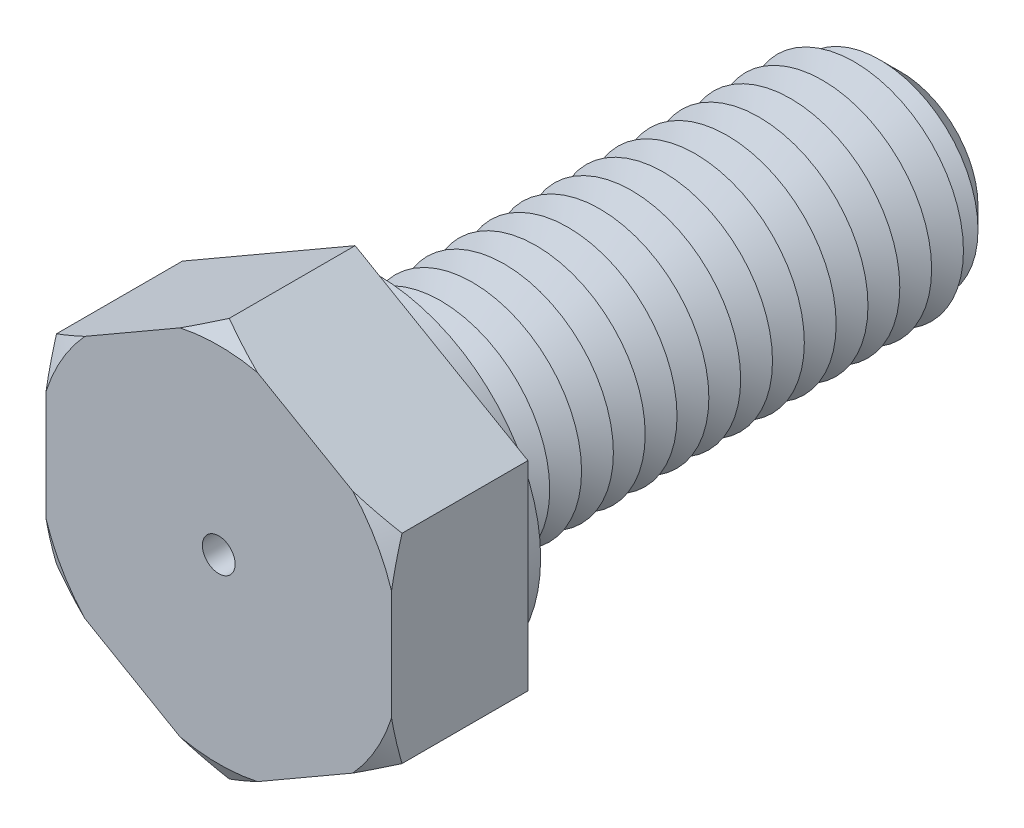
ISO-10303-21;
HEADER;
FILE_DESCRIPTION(('STEP AP214'),'2;1');
FILE_NAME('part.step','',(''),(''),'','','');
FILE_SCHEMA(('AUTOMOTIVE_DESIGN { 1 0 10303 214 1 1 1 1 }'));
ENDSEC;
DATA;
#1=APPLICATION_CONTEXT('core data for automotive mechanical design processes');
#2=APPLICATION_PROTOCOL_DEFINITION('international standard','automotive_design',2000,#1);
#3=PRODUCT_CONTEXT('',#1,'mechanical');
#4=PRODUCT('Part','Part','',(#3));
#5=PRODUCT_RELATED_PRODUCT_CATEGORY('part','',(#4));
#6=PRODUCT_DEFINITION_FORMATION('','',#4);
#7=PRODUCT_DEFINITION_CONTEXT('part definition',#1,'design');
#8=PRODUCT_DEFINITION('design','',#6,#7);
#9=PRODUCT_DEFINITION_SHAPE('','',#8);
#10=(LENGTH_UNIT() NAMED_UNIT(*) SI_UNIT(.MILLI.,.METRE.));
#11=(NAMED_UNIT(*) PLANE_ANGLE_UNIT() SI_UNIT($,.RADIAN.));
#12=(NAMED_UNIT(*) SI_UNIT($,.STERADIAN.) SOLID_ANGLE_UNIT());
#13=UNCERTAINTY_MEASURE_WITH_UNIT(LENGTH_MEASURE(1.E-05),#10,'distance_accuracy_value','');
#14=(GEOMETRIC_REPRESENTATION_CONTEXT(3) GLOBAL_UNCERTAINTY_ASSIGNED_CONTEXT((#13)) GLOBAL_UNIT_ASSIGNED_CONTEXT((#10,
#11,#12)) REPRESENTATION_CONTEXT('',''));
#15=CARTESIAN_POINT('',(0.,0.,0.));
#16=DIRECTION('',(0.,0.,1.));
#17=DIRECTION('',(1.,0.,0.));
#18=AXIS2_PLACEMENT_3D('',#15,#16,#17);
#19=CARTESIAN_POINT('',(9.5,5.48482755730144,7.5));
#20=DIRECTION('',(-0.5,-0.866025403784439,0.));
#21=DIRECTION('',(0.866025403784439,-0.5,0.));
#22=AXIS2_PLACEMENT_3D('',#19,#20,#21);
#23=PLANE('',#22);
#24=CARTESIAN_POINT('',(16.0911028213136,1.67945256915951,3.91531658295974));
#25=CARTESIAN_POINT('',(15.7926530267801,1.85176263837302,4.07633378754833));
#26=CARTESIAN_POINT('',(15.4934885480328,2.02448533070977,4.23561185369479));
#27=CARTESIAN_POINT('',(14.8934288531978,2.37092995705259,4.54987291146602));
#28=CARTESIAN_POINT('',(14.5925334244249,2.54465201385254,4.70485536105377));
#29=CARTESIAN_POINT('',(13.9878148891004,2.89378642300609,5.01015744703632));
#30=CARTESIAN_POINT('',(13.6839854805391,3.06920241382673,5.16046049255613));
#31=CARTESIAN_POINT('',(13.0740489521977,3.4213494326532,5.45475890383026));
#32=CARTESIAN_POINT('',(12.7679419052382,3.59808041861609,5.59875447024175));
#33=CARTESIAN_POINT('',(12.1452865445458,3.95757065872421,5.88261207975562));
#34=CARTESIAN_POINT('',(11.8286703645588,4.14036909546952,6.02227655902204));
#35=CARTESIAN_POINT('',(11.1922429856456,4.50781061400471,6.29164435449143));
#36=CARTESIAN_POINT('',(10.8724316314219,4.69245378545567,6.42134718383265));
#37=CARTESIAN_POINT('',(10.2295404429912,5.06362718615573,6.66831982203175));
#38=CARTESIAN_POINT('',(9.90646410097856,5.25015539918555,6.78560163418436));
#39=CARTESIAN_POINT('',(9.2565183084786,5.62540177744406,7.00502233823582));
#40=CARTESIAN_POINT('',(8.92964935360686,5.81411965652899,7.1071631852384));
#41=CARTESIAN_POINT('',(8.14786487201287,6.26548313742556,7.32807954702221));
#42=CARTESIAN_POINT('',(7.6911273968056,6.52918064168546,7.43861218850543));
#43=CARTESIAN_POINT('',(7.00135730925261,6.92741958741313,7.57140056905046));
#44=CARTESIAN_POINT('',(6.77066782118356,7.06060822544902,7.61016053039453));
#45=CARTESIAN_POINT('',(6.30799755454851,7.3277310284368,7.6757081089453));
#46=CARTESIAN_POINT('',(6.07601678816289,7.46166518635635,7.70249583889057));
#47=CARTESIAN_POINT('',(5.61390562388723,7.72846519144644,7.74308971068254));
#48=CARTESIAN_POINT('',(5.38378495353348,7.86132542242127,7.75704275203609));
#49=CARTESIAN_POINT('',(4.92322735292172,8.1272284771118,7.77208284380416));
#50=CARTESIAN_POINT('',(4.69279042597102,8.26027129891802,7.7731700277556));
#51=CARTESIAN_POINT('',(4.23214422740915,8.52622550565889,7.76244373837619));
#52=CARTESIAN_POINT('',(4.00193495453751,8.65913689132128,7.7506303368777));
#53=CARTESIAN_POINT('',(3.54223236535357,8.92454630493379,7.71446028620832));
#54=CARTESIAN_POINT('',(3.31273916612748,9.05704426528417,7.69010168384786));
#55=CARTESIAN_POINT('',(2.77042202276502,9.37015121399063,7.61833387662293));
#56=CARTESIAN_POINT('',(2.45810922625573,9.55046509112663,7.56573497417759));
#57=CARTESIAN_POINT('',(1.83647686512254,9.90936470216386,7.44074774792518));
#58=CARTESIAN_POINT('',(1.52715774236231,10.087950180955,7.36835654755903));
#59=CARTESIAN_POINT('',(0.911549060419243,10.4433720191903,7.20651778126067));
#60=CARTESIAN_POINT('',(0.605263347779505,10.6202061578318,7.1170509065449));
#61=CARTESIAN_POINT('',(-0.00386858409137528,10.9718886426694,6.92387899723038));
#62=CARTESIAN_POINT('',(-0.30671501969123,11.1467371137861,6.8201748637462));
#63=CARTESIAN_POINT('',(-0.912759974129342,11.496637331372,6.59968787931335));
#64=CARTESIAN_POINT('',(-1.21591973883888,11.6716667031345,6.48276398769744));
#65=CARTESIAN_POINT('',(-1.8190277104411,12.0198712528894,6.23911056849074));
#66=CARTESIAN_POINT('',(-2.11897790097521,12.1930475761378,6.11238754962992));
#67=CARTESIAN_POINT('',(-2.71614501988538,12.5378221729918,5.85087494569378));
#68=CARTESIAN_POINT('',(-3.01336251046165,12.7094207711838,5.71608706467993));
#69=CARTESIAN_POINT('',(-3.60546807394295,13.0512730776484,5.43985672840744));
#70=CARTESIAN_POINT('',(-3.90035610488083,13.2215267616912,5.29841415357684));
#71=CARTESIAN_POINT('',(-4.39671248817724,13.5080982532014,5.05486951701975));
#72=CARTESIAN_POINT('',(-4.59871463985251,13.624724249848,4.95421186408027));
#73=CARTESIAN_POINT('',(-5.00183994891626,13.8574687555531,4.75059724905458));
#74=CARTESIAN_POINT('',(-5.20296313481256,13.9735872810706,4.647640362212));
#75=CARTESIAN_POINT('',(-5.60231741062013,14.2041545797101,4.44078592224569));
#76=CARTESIAN_POINT('',(-5.80055672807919,14.3186081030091,4.33690951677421));
#77=CARTESIAN_POINT('',(-6.19633679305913,14.5471118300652,4.12738601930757));
#78=CARTESIAN_POINT('',(-6.39387752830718,14.6611620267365,4.02173889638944));
#79=CARTESIAN_POINT('',(-6.59110282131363,14.7750301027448,3.91531658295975));
#80=B_SPLINE_CURVE_WITH_KNOTS('',3,(#24,#25,#26,#27,#28,#29,#30,#31,#32,#33,#34,#35,#36,#37,#38,
#39,#40,#41,#42,#43,#44,#45,#46,#47,#48,#49,#50,#51,#52,#53,#54,#55,#56,#57,#58,#59,#60,#61,#62,
#63,#64,#65,#66,#67,#68,#69,#70,#71,#72,#73,#74,#75,#76,#77,#78,#79),.UNSPECIFIED.,.F.,.F.,(4,2,
2,2,2,2,2,2,2,2,2,2,2,2,2,2,2,2,2,2,2,2,2,2,2,2,2,4),(0.,1.14115474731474,2.28245284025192,
3.42741980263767,4.57235031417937,5.74632926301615,6.92036555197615,8.09325673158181,
9.26599632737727,10.8807998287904,11.6881240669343,12.4954407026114,13.2933978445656,
14.0913467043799,14.8892911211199,15.6873598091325,16.7800286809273,17.8728564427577,
18.9669273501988,20.0609290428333,21.1679585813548,22.2742590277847,23.380326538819,
24.4864139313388,25.2485345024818,26.010630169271,26.7647435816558,27.5188701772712),.UNSPECIFIED.);
#81=CARTESIAN_POINT('',(9.5,5.48482755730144,6.92264973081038));
#82=VERTEX_POINT('',#81);
#83=CARTESIAN_POINT('',(7.36878164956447,6.71528704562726,7.5));
#84=VERTEX_POINT('',#83);
#85=EDGE_CURVE('E132',#82,#84,#80,.T.);
#86=ORIENTED_EDGE('',*,*,#85,.F.);
#87=DIRECTION('',(0.,0.,-1.));
#88=VECTOR('',#87,1.);
#89=CARTESIAN_POINT('',(9.5,5.48482755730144,7.5));
#90=LINE('',#89,#88);
#91=CARTESIAN_POINT('',(9.5,5.48482755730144,0.));
#92=VERTEX_POINT('',#91);
#93=EDGE_CURVE('E144',#82,#92,#90,.T.);
#94=ORIENTED_EDGE('',*,*,#93,.T.);
#95=DIRECTION('',(-0.866025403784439,0.5,0.));
#96=VECTOR('',#95,1.);
#97=CARTESIAN_POINT('',(9.5,5.48482755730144,0.));
#98=LINE('',#97,#96);
#99=CARTESIAN_POINT('',(0.,10.9696551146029,0.));
#100=VERTEX_POINT('',#99);
#101=EDGE_CURVE('E330',#92,#100,#98,.T.);
#102=ORIENTED_EDGE('',*,*,#101,.T.);
#103=DIRECTION('',(0.,0.,-1.));
#104=VECTOR('',#103,1.);
#105=CARTESIAN_POINT('',(0.,10.9696551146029,7.5));
#106=LINE('',#105,#104);
#107=CARTESIAN_POINT('',(0.,10.9696551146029,6.92264973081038));
#108=VERTEX_POINT('',#107);
#109=EDGE_CURVE('E179',#108,#100,#106,.T.);
#110=ORIENTED_EDGE('',*,*,#109,.F.);
#111=CARTESIAN_POINT('',(2.13121835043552,9.73919562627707,7.5));
#112=VERTEX_POINT('',#111);
#113=EDGE_CURVE('E151',#112,#108,#80,.T.);
#114=ORIENTED_EDGE('',*,*,#113,.F.);
#115=DIRECTION('',(-0.866025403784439,0.5,0.));
#116=VECTOR('',#115,1.);
#117=CARTESIAN_POINT('',(9.5,5.48482755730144,7.5));
#118=LINE('',#117,#116);
#119=EDGE_CURVE('E148',#84,#112,#118,.T.);
#120=ORIENTED_EDGE('',*,*,#119,.F.);
#121=EDGE_LOOP('',(#86,#94,#102,#110,#114,#120));
#122=FACE_BOUND('',#121,.T.);
#123=ADVANCED_FACE('F39',(#122),#23,.F.);
#124=CARTESIAN_POINT('',(0.,10.9696551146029,7.5));
#125=DIRECTION('',(0.5,-0.866025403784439,0.));
#126=DIRECTION('',(0.866025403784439,0.5,0.));
#127=AXIS2_PLACEMENT_3D('',#124,#125,#126);
#128=PLANE('',#127);
#129=CARTESIAN_POINT('',(6.59110282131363,14.7750301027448,3.91531658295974));
#130=CARTESIAN_POINT('',(6.29265302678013,14.6027200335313,4.07633378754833));
#131=CARTESIAN_POINT('',(5.99348854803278,14.4299973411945,4.23561185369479));
#132=CARTESIAN_POINT('',(5.3934288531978,14.0835527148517,4.54987291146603));
#133=CARTESIAN_POINT('',(5.09253342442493,13.9098306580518,4.70485536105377));
#134=CARTESIAN_POINT('',(4.48781488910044,13.5606962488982,5.01015744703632));
#135=CARTESIAN_POINT('',(4.18398548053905,13.3852802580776,5.16046049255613));
#136=CARTESIAN_POINT('',(3.5740489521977,13.0331332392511,5.45475890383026));
#137=CARTESIAN_POINT('',(3.26794190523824,12.8564022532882,5.59875447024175));
#138=CARTESIAN_POINT('',(2.64528654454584,12.4969120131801,5.88261207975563));
#139=CARTESIAN_POINT('',(2.32867036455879,12.3141135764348,6.02227655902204));
#140=CARTESIAN_POINT('',(1.69224298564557,11.9466720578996,6.29164435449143));
#141=CARTESIAN_POINT('',(1.37243163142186,11.7620288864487,6.42134718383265));
#142=CARTESIAN_POINT('',(0.729540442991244,11.3908554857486,6.66831982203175));
#143=CARTESIAN_POINT('',(0.406464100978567,11.2043272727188,6.78560163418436));
#144=CARTESIAN_POINT('',(-0.243481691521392,10.8290808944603,7.00502233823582));
#145=CARTESIAN_POINT('',(-0.570350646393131,10.6403630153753,7.1071631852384));
#146=CARTESIAN_POINT('',(-1.35213512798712,10.1889995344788,7.32807954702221));
#147=CARTESIAN_POINT('',(-1.80887260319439,9.92530203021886,7.43861218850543));
#148=CARTESIAN_POINT('',(-2.49864269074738,9.52706308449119,7.57140056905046));
#149=CARTESIAN_POINT('',(-2.72933217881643,9.39387444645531,7.61016053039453));
#150=CARTESIAN_POINT('',(-3.19200244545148,9.12675164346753,7.6757081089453));
#151=CARTESIAN_POINT('',(-3.4239832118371,8.99281748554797,7.70249583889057));
#152=CARTESIAN_POINT('',(-3.88609437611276,8.72601748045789,7.74308971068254));
#153=CARTESIAN_POINT('',(-4.11621504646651,8.59315724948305,7.75704275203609));
#154=CARTESIAN_POINT('',(-4.57677264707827,8.32725419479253,7.77208284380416));
#155=CARTESIAN_POINT('',(-4.80720957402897,8.19421137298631,7.7731700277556));
#156=CARTESIAN_POINT('',(-5.26785577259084,7.92825716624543,7.76244373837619));
#157=CARTESIAN_POINT('',(-5.49806504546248,7.79534578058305,7.7506303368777));
#158=CARTESIAN_POINT('',(-5.95776763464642,7.52993636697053,7.71446028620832));
#159=CARTESIAN_POINT('',(-6.18726083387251,7.39743840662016,7.69010168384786));
#160=CARTESIAN_POINT('',(-6.72957797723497,7.0843314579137,7.61833387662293));
#161=CARTESIAN_POINT('',(-7.04189077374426,6.90401758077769,7.56573497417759));
#162=CARTESIAN_POINT('',(-7.66352313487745,6.54511796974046,7.44074774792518));
#163=CARTESIAN_POINT('',(-7.97284225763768,6.36653249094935,7.36835654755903));
#164=CARTESIAN_POINT('',(-8.58845093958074,6.01111065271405,7.20651778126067));
#165=CARTESIAN_POINT('',(-8.89473665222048,5.83427651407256,7.1170509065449));
#166=CARTESIAN_POINT('',(-9.50386858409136,5.48259402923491,6.92387899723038));
#167=CARTESIAN_POINT('',(-9.80671501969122,5.30774555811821,6.8201748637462));
#168=CARTESIAN_POINT('',(-10.4127599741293,4.95784534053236,6.59968787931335));
#169=CARTESIAN_POINT('',(-10.7159197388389,4.78281596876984,6.48276398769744));
#170=CARTESIAN_POINT('',(-11.3190277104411,4.43461141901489,6.23911056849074));
#171=CARTESIAN_POINT('',(-11.6189779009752,4.26143509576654,6.11238754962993));
#172=CARTESIAN_POINT('',(-12.2161450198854,3.91666049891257,5.85087494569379));
#173=CARTESIAN_POINT('',(-12.5133625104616,3.74506190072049,5.71608706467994));
#174=CARTESIAN_POINT('',(-13.1054680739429,3.40320959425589,5.43985672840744));
#175=CARTESIAN_POINT('',(-13.4003561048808,3.2329559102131,5.29841415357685));
#176=CARTESIAN_POINT('',(-13.8967124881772,2.94638441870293,5.05486951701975));
#177=CARTESIAN_POINT('',(-14.0987146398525,2.82975842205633,4.95421186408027));
#178=CARTESIAN_POINT('',(-14.5018399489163,2.59701391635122,4.75059724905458));
#179=CARTESIAN_POINT('',(-14.7029631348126,2.48089539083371,4.647640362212));
#180=CARTESIAN_POINT('',(-15.1023174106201,2.25032809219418,4.44078592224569));
#181=CARTESIAN_POINT('',(-15.3005567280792,2.13587456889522,4.33690951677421));
#182=CARTESIAN_POINT('',(-15.6963367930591,1.90737084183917,4.12738601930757));
#183=CARTESIAN_POINT('',(-15.8938775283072,1.79332064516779,4.02173889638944));
#184=CARTESIAN_POINT('',(-16.0911028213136,1.67945256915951,3.91531658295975));
#185=B_SPLINE_CURVE_WITH_KNOTS('',3,(#129,#130,#131,#132,#133,#134,#135,#136,#137,#138,#139,
#140,#141,#142,#143,#144,#145,#146,#147,#148,#149,#150,#151,#152,#153,#154,#155,#156,#157,#158,
#159,#160,#161,#162,#163,#164,#165,#166,#167,#168,#169,#170,#171,#172,#173,#174,#175,#176,#177,
#178,#179,#180,#181,#182,#183,#184),.UNSPECIFIED.,.F.,.F.,(4,2,2,2,2,2,2,2,2,2,2,2,2,2,2,2,2,2,
2,2,2,2,2,2,2,2,2,4),(0.,1.14115474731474,2.28245284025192,3.42741980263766,4.57235031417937,
5.74632926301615,6.92036555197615,8.09325673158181,9.26599632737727,10.8807998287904,
11.6881240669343,12.4954407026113,13.2933978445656,14.0913467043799,14.8892911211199,
15.6873598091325,16.7800286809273,17.8728564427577,18.9669273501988,20.0609290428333,
21.1679585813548,22.2742590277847,23.380326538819,24.4864139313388,25.2485345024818,
26.010630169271,26.7647435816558,27.5188701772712),.UNSPECIFIED.);
#186=CARTESIAN_POINT('',(-2.13121835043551,9.73919562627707,7.5));
#187=VERTEX_POINT('',#186);
#188=EDGE_CURVE('E457',#108,#187,#185,.T.);
#189=ORIENTED_EDGE('',*,*,#188,.F.);
#190=ORIENTED_EDGE('',*,*,#109,.T.);
#191=DIRECTION('',(-0.866025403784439,-0.5,0.));
#192=VECTOR('',#191,1.);
#193=CARTESIAN_POINT('',(0.,10.9696551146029,0.));
#194=LINE('',#193,#192);
#195=CARTESIAN_POINT('',(-9.5,5.48482755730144,0.));
#196=VERTEX_POINT('',#195);
#197=EDGE_CURVE('E350',#100,#196,#194,.T.);
#198=ORIENTED_EDGE('',*,*,#197,.T.);
#199=DIRECTION('',(0.,0.,-1.));
#200=VECTOR('',#199,1.);
#201=CARTESIAN_POINT('',(-9.5,5.48482755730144,7.5));
#202=LINE('',#201,#200);
#203=CARTESIAN_POINT('',(-9.5,5.48482755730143,6.92264973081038));
#204=VERTEX_POINT('',#203);
#205=EDGE_CURVE('E176',#204,#196,#202,.T.);
#206=ORIENTED_EDGE('',*,*,#205,.F.);
#207=CARTESIAN_POINT('',(-7.36878164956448,6.71528704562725,7.5));
#208=VERTEX_POINT('',#207);
#209=EDGE_CURVE('E452',#208,#204,#185,.T.);
#210=ORIENTED_EDGE('',*,*,#209,.F.);
#211=DIRECTION('',(-0.866025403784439,-0.5,0.));
#212=VECTOR('',#211,1.);
#213=CARTESIAN_POINT('',(0.,10.9696551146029,7.5));
#214=LINE('',#213,#212);
#215=EDGE_CURVE('E333',#187,#208,#214,.T.);
#216=ORIENTED_EDGE('',*,*,#215,.F.);
#217=EDGE_LOOP('',(#189,#190,#198,#206,#210,#216));
#218=FACE_BOUND('',#217,.T.);
#219=ADVANCED_FACE('F405',(#218),#128,.F.);
#220=CARTESIAN_POINT('',(-9.5,5.48482755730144,7.5));
#221=DIRECTION('',(1.,0.,0.));
#222=DIRECTION('',(0.,1.,0.));
#223=AXIS2_PLACEMENT_3D('',#220,#221,#222);
#224=PLANE('',#223);
#225=CARTESIAN_POINT('',(-9.5,12.0759303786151,4.38509256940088));
#226=CARTESIAN_POINT('',(-9.5,11.7327439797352,4.5407773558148));
#227=CARTESIAN_POINT('',(-9.5,11.388618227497,4.69443095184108));
#228=CARTESIAN_POINT('',(-9.5,10.698085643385,4.99669009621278));
#229=CARTESIAN_POINT('',(-9.5,10.3516784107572,5.1452947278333));
#230=CARTESIAN_POINT('',(-9.5,9.65484997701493,5.43702212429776));
#231=CARTESIAN_POINT('',(-9.5,9.30441804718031,5.58011936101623));
#232=CARTESIAN_POINT('',(-9.5,8.60059023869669,5.85880989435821));
#233=CARTESIAN_POINT('',(-9.5,8.24719449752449,5.9944035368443));
#234=CARTESIAN_POINT('',(-9.5,7.53860340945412,6.25582574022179));
#235=CARTESIAN_POINT('',(-9.5,7.18342337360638,6.38169559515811));
#236=CARTESIAN_POINT('',(-9.5,6.46926569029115,6.62229858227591));
#237=CARTESIAN_POINT('',(-9.5,6.11028785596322,6.73703116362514));
#238=CARTESIAN_POINT('',(-9.5,5.38872372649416,6.95272419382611));
#239=CARTESIAN_POINT('',(-9.5,5.02614305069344,7.05370330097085));
#240=CARTESIAN_POINT('',(-9.5,4.29675196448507,7.23920160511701));
#241=CARTESIAN_POINT('',(-9.5,3.92994173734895,7.32372151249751));
#242=CARTESIAN_POINT('',(-9.5,3.29665308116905,7.45205940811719));
#243=CARTESIAN_POINT('',(-9.5,3.03113701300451,7.50062833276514));
#244=CARTESIAN_POINT('',(-9.5,2.49832809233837,7.5865841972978));
#245=CARTESIAN_POINT('',(-9.5,2.23103554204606,7.62397299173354));
#246=CARTESIAN_POINT('',(-9.5,1.69506861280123,7.68659004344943));
#247=CARTESIAN_POINT('',(-9.5,1.42639449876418,7.71182055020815));
#248=CARTESIAN_POINT('',(-9.5,0.888138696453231,7.74939803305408));
#249=CARTESIAN_POINT('',(-9.5,0.618557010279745,7.76174503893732));
#250=CARTESIAN_POINT('',(-9.5,0.0792458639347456,7.77317034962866));
#251=CARTESIAN_POINT('',(-9.5,-0.190483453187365,7.77225534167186));
#252=CARTESIAN_POINT('',(-9.5,-0.729567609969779,7.75720205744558));
#253=CARTESIAN_POINT('',(-9.5,-0.998922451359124,7.74306384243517));
#254=CARTESIAN_POINT('',(-9.5,-1.53667618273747,7.70199575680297));
#255=CARTESIAN_POINT('',(-9.5,-1.80507496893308,7.67506453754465));
#256=CARTESIAN_POINT('',(-9.5,-2.34038611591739,7.60918517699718));
#257=CARTESIAN_POINT('',(-9.5,-2.60729841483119,7.57023653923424));
#258=CARTESIAN_POINT('',(-9.5,-3.27166409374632,7.45918941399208));
#259=CARTESIAN_POINT('',(-9.5,-3.66797754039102,7.38023980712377));
#260=CARTESIAN_POINT('',(-9.5,-4.45585575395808,7.20141943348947));
#261=CARTESIAN_POINT('',(-9.5,-4.8474194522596,7.10154404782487));
#262=CARTESIAN_POINT('',(-9.5,-5.6265713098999,6.88438943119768));
#263=CARTESIAN_POINT('',(-9.5,-6.01414884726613,6.76707245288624));
#264=CARTESIAN_POINT('',(-9.5,-6.78474185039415,6.51851091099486));
#265=CARTESIAN_POINT('',(-9.5,-7.16775763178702,6.38726731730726));
#266=CARTESIAN_POINT('',(-9.5,-7.93407213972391,6.11202298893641));
#267=CARTESIAN_POINT('',(-9.5,-8.31732458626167,5.96789419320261));
#268=CARTESIAN_POINT('',(-9.5,-9.08024927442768,5.67043108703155));
#269=CARTESIAN_POINT('',(-9.5,-9.4599212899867,5.51709619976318));
#270=CARTESIAN_POINT('',(-9.5,-10.2138362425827,5.20397874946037));
#271=CARTESIAN_POINT('',(-9.5,-10.5880982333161,5.04424191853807));
#272=CARTESIAN_POINT('',(-9.5,-11.1474871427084,4.80018423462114));
#273=CARTESIAN_POINT('',(-9.5,-11.3335947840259,4.71809930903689));
#274=CARTESIAN_POINT('',(-9.5,-11.7052038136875,4.55257683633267));
#275=CARTESIAN_POINT('',(-9.5,-11.8907052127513,4.46913931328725));
#276=CARTESIAN_POINT('',(-9.5,-12.0759303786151,4.38509256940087));
#277=B_SPLINE_CURVE_WITH_KNOTS('',3,(#225,#226,#227,#228,#229,#230,#231,#232,#233,#234,#235,
#236,#237,#238,#239,#240,#241,#242,#243,#244,#245,#246,#247,#248,#249,#250,#251,#252,#253,#254,
#255,#256,#257,#258,#259,#260,#261,#262,#263,#264,#265,#266,#267,#268,#269,#270,#271,#272,#273,
#274,#275,#276),.UNSPECIFIED.,.F.,.F.,(4,2,2,2,2,2,2,2,2,2,2,2,2,2,2,2,2,2,2,2,2,2,2,2,2,4),(0.,
1.13056270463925,2.26132959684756,3.39682602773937,4.53227007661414,5.66259174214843,
6.79296928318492,7.92179771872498,9.0505774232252,9.86013572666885,10.6695596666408,
11.4788337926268,12.288106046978,13.0969702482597,13.9058307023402,14.7147764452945,
15.5237556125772,16.7353316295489,17.9471753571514,19.1616810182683,20.3761021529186,
21.6043286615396,22.8326322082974,24.0533405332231,24.6635541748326,25.273756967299),.UNSPECIFIED.);
#278=CARTESIAN_POINT('',(-9.5,3.02390858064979,7.5));
#279=VERTEX_POINT('',#278);
#280=EDGE_CURVE('E450',#204,#279,#277,.T.);
#281=ORIENTED_EDGE('',*,*,#280,.F.);
#282=ORIENTED_EDGE('',*,*,#205,.T.);
#283=DIRECTION('',(0.,-1.,0.));
#284=VECTOR('',#283,1.);
#285=CARTESIAN_POINT('',(-9.5,5.48482755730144,0.));
#286=LINE('',#285,#284);
#287=CARTESIAN_POINT('',(-9.5,-5.48482755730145,0.));
#288=VERTEX_POINT('',#287);
#289=EDGE_CURVE('E354',#196,#288,#286,.T.);
#290=ORIENTED_EDGE('',*,*,#289,.T.);
#291=DIRECTION('',(0.,0.,-1.));
#292=VECTOR('',#291,1.);
#293=CARTESIAN_POINT('',(-9.5,-5.48482755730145,7.5));
#294=LINE('',#293,#292);
#295=CARTESIAN_POINT('',(-9.49999999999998,-5.48482755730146,6.92264973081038));
#296=VERTEX_POINT('',#295);
#297=EDGE_CURVE('E173',#296,#288,#294,.T.);
#298=ORIENTED_EDGE('',*,*,#297,.F.);
#299=CARTESIAN_POINT('',(-9.5,-3.02390858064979,7.5));
#300=VERTEX_POINT('',#299);
#301=EDGE_CURVE('E445',#300,#296,#277,.T.);
#302=ORIENTED_EDGE('',*,*,#301,.F.);
#303=DIRECTION('',(0.,-1.,0.));
#304=VECTOR('',#303,1.);
#305=CARTESIAN_POINT('',(-9.5,5.48482755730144,7.5));
#306=LINE('',#305,#304);
#307=EDGE_CURVE('E337',#279,#300,#306,.T.);
#308=ORIENTED_EDGE('',*,*,#307,.F.);
#309=EDGE_LOOP('',(#281,#282,#290,#298,#302,#308));
#310=FACE_BOUND('',#309,.T.);
#311=ADVANCED_FACE('F409',(#310),#224,.F.);
#312=CARTESIAN_POINT('',(-9.5,-5.48482755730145,7.5));
#313=DIRECTION('',(0.5,0.866025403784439,0.));
#314=DIRECTION('',(-0.866025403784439,0.5,0.));
#315=AXIS2_PLACEMENT_3D('',#312,#313,#314);
#316=PLANE('',#315);
#317=CARTESIAN_POINT('',(-16.0911028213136,-1.67945256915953,3.91531658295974));
#318=CARTESIAN_POINT('',(-15.7926530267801,-1.85176263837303,4.07633378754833));
#319=CARTESIAN_POINT('',(-15.4934885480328,-2.02448533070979,4.23561185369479));
#320=CARTESIAN_POINT('',(-14.8934288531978,-2.37092995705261,4.54987291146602));
#321=CARTESIAN_POINT('',(-14.5925334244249,-2.54465201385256,4.70485536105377));
#322=CARTESIAN_POINT('',(-13.9878148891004,-2.89378642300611,5.01015744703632));
#323=CARTESIAN_POINT('',(-13.683985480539,-3.06920241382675,5.16046049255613));
#324=CARTESIAN_POINT('',(-13.0740489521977,-3.42134943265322,5.45475890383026));
#325=CARTESIAN_POINT('',(-12.7679419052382,-3.5980804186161,5.59875447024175));
#326=CARTESIAN_POINT('',(-12.1452865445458,-3.95757065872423,5.88261207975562));
#327=CARTESIAN_POINT('',(-11.8286703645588,-4.14036909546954,6.02227655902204));
#328=CARTESIAN_POINT('',(-11.1922429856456,-4.50781061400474,6.29164435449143));
#329=CARTESIAN_POINT('',(-10.8724316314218,-4.69245378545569,6.42134718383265));
#330=CARTESIAN_POINT('',(-10.2295404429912,-5.06362718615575,6.66831982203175));
#331=CARTESIAN_POINT('',(-9.90646410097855,-5.25015539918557,6.78560163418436));
#332=CARTESIAN_POINT('',(-9.25651830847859,-5.62540177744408,7.00502233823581));
#333=CARTESIAN_POINT('',(-8.92964935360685,-5.81411965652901,7.1071631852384));
#334=CARTESIAN_POINT('',(-8.14786487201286,-6.26548313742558,7.32807954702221));
#335=CARTESIAN_POINT('',(-7.69112739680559,-6.52918064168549,7.43861218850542));
#336=CARTESIAN_POINT('',(-7.0013573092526,-6.92741958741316,7.57140056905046));
#337=CARTESIAN_POINT('',(-6.77066782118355,-7.06060822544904,7.61016053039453));
#338=CARTESIAN_POINT('',(-6.3079975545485,-7.32773102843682,7.6757081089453));
#339=CARTESIAN_POINT('',(-6.07601678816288,-7.46166518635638,7.70249583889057));
#340=CARTESIAN_POINT('',(-5.61390562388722,-7.72846519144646,7.74308971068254));
#341=CARTESIAN_POINT('',(-5.38378495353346,-7.8613254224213,7.75704275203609));
#342=CARTESIAN_POINT('',(-4.9232273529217,-8.12722847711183,7.77208284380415));
#343=CARTESIAN_POINT('',(-4.692790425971,-8.26027129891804,7.77317002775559));
#344=CARTESIAN_POINT('',(-4.23214422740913,-8.52622550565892,7.76244373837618));
#345=CARTESIAN_POINT('',(-4.00193495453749,-8.6591368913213,7.75063033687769));
#346=CARTESIAN_POINT('',(-3.54223236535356,-8.92454630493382,7.71446028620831));
#347=CARTESIAN_POINT('',(-3.31273916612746,-9.05704426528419,7.69010168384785));
#348=CARTESIAN_POINT('',(-2.770422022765,-9.37015121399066,7.61833387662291));
#349=CARTESIAN_POINT('',(-2.45810922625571,-9.55046509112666,7.56573497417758));
#350=CARTESIAN_POINT('',(-1.83647686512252,-9.9093647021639,7.44074774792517));
#351=CARTESIAN_POINT('',(-1.52715774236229,-10.087950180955,7.36835654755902));
#352=CARTESIAN_POINT('',(-0.911549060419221,-10.4433720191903,7.20651778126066));
#353=CARTESIAN_POINT('',(-0.605263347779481,-10.6202061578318,7.11705090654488));
#354=CARTESIAN_POINT('',(0.00386858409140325,-10.9718886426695,6.92387899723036));
#355=CARTESIAN_POINT('',(0.30671501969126,-11.1467371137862,6.82017486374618));
#356=CARTESIAN_POINT('',(0.912759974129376,-11.496637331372,6.59968787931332));
#357=CARTESIAN_POINT('',(1.21591973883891,-11.6716667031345,6.48276398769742));
#358=CARTESIAN_POINT('',(1.81902771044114,-12.0198712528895,6.23911056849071));
#359=CARTESIAN_POINT('',(2.11897790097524,-12.1930475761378,6.11238754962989));
#360=CARTESIAN_POINT('',(2.71614501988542,-12.5378221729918,5.85087494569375));
#361=CARTESIAN_POINT('',(3.01336251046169,-12.7094207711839,5.7160870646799));
#362=CARTESIAN_POINT('',(3.60546807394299,-13.0512730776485,5.4398567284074));
#363=CARTESIAN_POINT('',(3.90035610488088,-13.2215267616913,5.29841415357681));
#364=CARTESIAN_POINT('',(4.39671248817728,-13.5080982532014,5.05486951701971));
#365=CARTESIAN_POINT('',(4.59871463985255,-13.624724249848,4.95421186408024));
#366=CARTESIAN_POINT('',(5.00183994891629,-13.8574687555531,4.75059724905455));
#367=CARTESIAN_POINT('',(5.20296313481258,-13.9735872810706,4.64764036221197));
#368=CARTESIAN_POINT('',(5.60231741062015,-14.2041545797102,4.44078592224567));
#369=CARTESIAN_POINT('',(5.8005567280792,-14.3186081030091,4.33690951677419));
#370=CARTESIAN_POINT('',(6.19633679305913,-14.5471118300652,4.12738601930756));
#371=CARTESIAN_POINT('',(6.39387752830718,-14.6611620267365,4.02173889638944));
#372=CARTESIAN_POINT('',(6.59110282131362,-14.7750301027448,3.91531658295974));
#373=B_SPLINE_CURVE_WITH_KNOTS('',3,(#317,#318,#319,#320,#321,#322,#323,#324,#325,#326,#327,
#328,#329,#330,#331,#332,#333,#334,#335,#336,#337,#338,#339,#340,#341,#342,#343,#344,#345,#346,
#347,#348,#349,#350,#351,#352,#353,#354,#355,#356,#357,#358,#359,#360,#361,#362,#363,#364,#365,
#366,#367,#368,#369,#370,#371,#372),.UNSPECIFIED.,.F.,.F.,(4,2,2,2,2,2,2,2,2,2,2,2,2,2,2,2,2,2,
2,2,2,2,2,2,2,2,2,4),(0.,1.14115474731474,2.28245284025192,3.42741980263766,4.57235031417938,
5.74632926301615,6.92036555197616,8.09325673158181,9.26599632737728,10.8807998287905,
11.6881240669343,12.4954407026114,13.2933978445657,14.0913467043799,14.8892911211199,
15.6873598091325,16.7800286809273,17.8728564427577,18.9669273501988,20.0609290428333,
21.1679585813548,22.2742590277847,23.3803265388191,24.4864139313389,25.2485345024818,
26.010630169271,26.7647435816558,27.5188701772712),.UNSPECIFIED.);
#374=CARTESIAN_POINT('',(-7.36878164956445,-6.71528704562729,7.5));
#375=VERTEX_POINT('',#374);
#376=EDGE_CURVE('E451',#296,#375,#373,.T.);
#377=ORIENTED_EDGE('',*,*,#376,.F.);
#378=ORIENTED_EDGE('',*,*,#297,.T.);
#379=DIRECTION('',(0.866025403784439,-0.5,0.));
#380=VECTOR('',#379,1.);
#381=CARTESIAN_POINT('',(-9.5,-5.48482755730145,0.));
#382=LINE('',#381,#380);
#383=CARTESIAN_POINT('',(0.,-10.9696551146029,0.));
#384=VERTEX_POINT('',#383);
#385=EDGE_CURVE('E358',#288,#384,#382,.T.);
#386=ORIENTED_EDGE('',*,*,#385,.T.);
#387=DIRECTION('',(0.,0.,-1.));
#388=VECTOR('',#387,1.);
#389=CARTESIAN_POINT('',(0.,-10.9696551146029,7.5));
#390=LINE('',#389,#388);
#391=CARTESIAN_POINT('',(0.,-10.9696551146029,6.92264973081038));
#392=VERTEX_POINT('',#391);
#393=EDGE_CURVE('E163',#392,#384,#390,.T.);
#394=ORIENTED_EDGE('',*,*,#393,.F.);
#395=CARTESIAN_POINT('',(-2.13121835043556,-9.73919562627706,7.5));
#396=VERTEX_POINT('',#395);
#397=EDGE_CURVE('E428',#396,#392,#373,.T.);
#398=ORIENTED_EDGE('',*,*,#397,.F.);
#399=DIRECTION('',(0.866025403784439,-0.5,0.));
#400=VECTOR('',#399,1.);
#401=CARTESIAN_POINT('',(-9.5,-5.48482755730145,7.5));
#402=LINE('',#401,#400);
#403=EDGE_CURVE('E341',#375,#396,#402,.T.);
#404=ORIENTED_EDGE('',*,*,#403,.F.);
#405=EDGE_LOOP('',(#377,#378,#386,#394,#398,#404));
#406=FACE_BOUND('',#405,.T.);
#407=ADVANCED_FACE('F436',(#406),#316,.F.);
#408=CARTESIAN_POINT('',(0.,-10.9696551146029,7.5));
#409=DIRECTION('',(-0.5,0.866025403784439,0.));
#410=DIRECTION('',(-0.866025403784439,-0.5,0.));
#411=AXIS2_PLACEMENT_3D('',#408,#409,#410);
#412=PLANE('',#411);
#413=CARTESIAN_POINT('',(-6.59110282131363,-14.7750301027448,3.91531658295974));
#414=CARTESIAN_POINT('',(-6.29265302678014,-14.6027200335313,4.07633378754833));
#415=CARTESIAN_POINT('',(-5.99348854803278,-14.4299973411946,4.23561185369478));
#416=CARTESIAN_POINT('',(-5.3934288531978,-14.0835527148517,4.54987291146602));
#417=CARTESIAN_POINT('',(-5.09253342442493,-13.9098306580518,4.70485536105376));
#418=CARTESIAN_POINT('',(-4.48781488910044,-13.5606962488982,5.01015744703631));
#419=CARTESIAN_POINT('',(-4.18398548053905,-13.3852802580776,5.16046049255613));
#420=CARTESIAN_POINT('',(-3.5740489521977,-13.0331332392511,5.45475890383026));
#421=CARTESIAN_POINT('',(-3.26794190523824,-12.8564022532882,5.59875447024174));
#422=CARTESIAN_POINT('',(-2.64528654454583,-12.4969120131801,5.88261207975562));
#423=CARTESIAN_POINT('',(-2.32867036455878,-12.3141135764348,6.02227655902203));
#424=CARTESIAN_POINT('',(-1.69224298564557,-11.9466720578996,6.29164435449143));
#425=CARTESIAN_POINT('',(-1.37243163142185,-11.7620288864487,6.42134718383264));
#426=CARTESIAN_POINT('',(-0.729540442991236,-11.3908554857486,6.66831982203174));
#427=CARTESIAN_POINT('',(-0.406464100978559,-11.2043272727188,6.78560163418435));
#428=CARTESIAN_POINT('',(0.243481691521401,-10.8290808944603,7.00502233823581));
#429=CARTESIAN_POINT('',(0.570350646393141,-10.6403630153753,7.10716318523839));
#430=CARTESIAN_POINT('',(1.35213512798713,-10.1889995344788,7.3280795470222));
#431=CARTESIAN_POINT('',(1.8088726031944,-9.92530203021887,7.43861218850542));
#432=CARTESIAN_POINT('',(2.49864269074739,-9.5270630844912,7.57140056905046));
#433=CARTESIAN_POINT('',(2.72933217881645,-9.39387444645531,7.61016053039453));
#434=CARTESIAN_POINT('',(3.19200244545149,-9.12675164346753,7.6757081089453));
#435=CARTESIAN_POINT('',(3.42398321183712,-8.99281748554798,7.70249583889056));
#436=CARTESIAN_POINT('',(3.88609437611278,-8.72601748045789,7.74308971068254));
#437=CARTESIAN_POINT('',(4.11621504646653,-8.59315724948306,7.75704275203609));
#438=CARTESIAN_POINT('',(4.57677264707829,-8.32725419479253,7.77208284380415));
#439=CARTESIAN_POINT('',(4.80720957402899,-8.19421137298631,7.77317002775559));
#440=CARTESIAN_POINT('',(5.26785577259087,-7.92825716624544,7.76244373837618));
#441=CARTESIAN_POINT('',(5.4980650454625,-7.79534578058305,7.75063033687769));
#442=CARTESIAN_POINT('',(5.95776763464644,-7.52993636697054,7.71446028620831));
#443=CARTESIAN_POINT('',(6.18726083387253,-7.39743840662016,7.69010168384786));
#444=CARTESIAN_POINT('',(6.72957797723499,-7.0843314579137,7.61833387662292));
#445=CARTESIAN_POINT('',(7.04189077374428,-6.9040175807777,7.56573497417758));
#446=CARTESIAN_POINT('',(7.66352313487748,-6.54511796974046,7.44074774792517));
#447=CARTESIAN_POINT('',(7.97284225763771,-6.36653249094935,7.36835654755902));
#448=CARTESIAN_POINT('',(8.58845093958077,-6.01111065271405,7.20651778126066));
#449=CARTESIAN_POINT('',(8.89473665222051,-5.83427651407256,7.11705090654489));
#450=CARTESIAN_POINT('',(9.50386858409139,-5.48259402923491,6.92387899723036));
#451=CARTESIAN_POINT('',(9.80671501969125,-5.30774555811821,6.82017486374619));
#452=CARTESIAN_POINT('',(10.4127599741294,-4.95784534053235,6.59968787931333));
#453=CARTESIAN_POINT('',(10.7159197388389,-4.78281596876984,6.48276398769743));
#454=CARTESIAN_POINT('',(11.3190277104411,-4.43461141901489,6.23911056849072));
#455=CARTESIAN_POINT('',(11.6189779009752,-4.26143509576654,6.1123875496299));
#456=CARTESIAN_POINT('',(12.2161450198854,-3.91666049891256,5.85087494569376));
#457=CARTESIAN_POINT('',(12.5133625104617,-3.74506190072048,5.71608706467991));
#458=CARTESIAN_POINT('',(13.105468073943,-3.40320959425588,5.43985672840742));
#459=CARTESIAN_POINT('',(13.4003561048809,-3.23295591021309,5.29841415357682));
#460=CARTESIAN_POINT('',(13.8967124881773,-2.94638441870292,5.05486951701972));
#461=CARTESIAN_POINT('',(14.0987146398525,-2.82975842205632,4.95421186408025));
#462=CARTESIAN_POINT('',(14.5018399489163,-2.59701391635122,4.75059724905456));
#463=CARTESIAN_POINT('',(14.7029631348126,-2.48089539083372,4.64764036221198));
#464=CARTESIAN_POINT('',(15.1023174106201,-2.25032809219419,4.44078592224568));
#465=CARTESIAN_POINT('',(15.3005567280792,-2.13587456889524,4.3369095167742));
#466=CARTESIAN_POINT('',(15.6963367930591,-1.90737084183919,4.12738601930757));
#467=CARTESIAN_POINT('',(15.8938775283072,-1.79332064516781,4.02173889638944));
#468=CARTESIAN_POINT('',(16.0911028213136,-1.67945256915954,3.91531658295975));
#469=B_SPLINE_CURVE_WITH_KNOTS('',3,(#413,#414,#415,#416,#417,#418,#419,#420,#421,#422,#423,
#424,#425,#426,#427,#428,#429,#430,#431,#432,#433,#434,#435,#436,#437,#438,#439,#440,#441,#442,
#443,#444,#445,#446,#447,#448,#449,#450,#451,#452,#453,#454,#455,#456,#457,#458,#459,#460,#461,
#462,#463,#464,#465,#466,#467,#468),.UNSPECIFIED.,.F.,.F.,(4,2,2,2,2,2,2,2,2,2,2,2,2,2,2,2,2,2,
2,2,2,2,2,2,2,2,2,4),(0.,1.14115474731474,2.28245284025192,3.42741980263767,4.57235031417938,
5.74632926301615,6.92036555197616,8.09325673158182,9.26599632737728,10.8807998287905,
11.6881240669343,12.4954407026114,13.2933978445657,14.0913467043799,14.8892911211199,
15.6873598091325,16.7800286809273,17.8728564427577,18.9669273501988,20.0609290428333,
21.1679585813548,22.2742590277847,23.3803265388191,24.4864139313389,25.2485345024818,
26.010630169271,26.7647435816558,27.5188701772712),.UNSPECIFIED.);
#470=CARTESIAN_POINT('',(2.13121835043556,-9.73919562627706,7.5));
#471=VERTEX_POINT('',#470);
#472=EDGE_CURVE('E64',#392,#471,#469,.T.);
#473=ORIENTED_EDGE('',*,*,#472,.F.);
#474=ORIENTED_EDGE('',*,*,#393,.T.);
#475=DIRECTION('',(0.866025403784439,0.5,0.));
#476=VECTOR('',#475,1.);
#477=CARTESIAN_POINT('',(0.,-10.9696551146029,0.));
#478=LINE('',#477,#476);
#479=CARTESIAN_POINT('',(9.5,-5.48482755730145,0.));
#480=VERTEX_POINT('',#479);
#481=EDGE_CURVE('E361',#384,#480,#478,.T.);
#482=ORIENTED_EDGE('',*,*,#481,.T.);
#483=DIRECTION('',(0.,0.,-1.));
#484=VECTOR('',#483,1.);
#485=CARTESIAN_POINT('',(9.5,-5.48482755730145,7.5));
#486=LINE('',#485,#484);
#487=CARTESIAN_POINT('',(9.5,-5.48482755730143,6.92264973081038));
#488=VERTEX_POINT('',#487);
#489=EDGE_CURVE('E157',#488,#480,#486,.T.);
#490=ORIENTED_EDGE('',*,*,#489,.F.);
#491=CARTESIAN_POINT('',(7.36878164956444,-6.71528704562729,7.5));
#492=VERTEX_POINT('',#491);
#493=EDGE_CURVE('E369',#492,#488,#469,.T.);
#494=ORIENTED_EDGE('',*,*,#493,.F.);
#495=DIRECTION('',(0.866025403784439,0.5,0.));
#496=VECTOR('',#495,1.);
#497=CARTESIAN_POINT('',(0.,-10.9696551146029,7.5));
#498=LINE('',#497,#496);
#499=EDGE_CURVE('E166',#471,#492,#498,.T.);
#500=ORIENTED_EDGE('',*,*,#499,.F.);
#501=EDGE_LOOP('',(#473,#474,#482,#490,#494,#500));
#502=FACE_BOUND('',#501,.T.);
#503=ADVANCED_FACE('F386',(#502),#412,.F.);
#504=CARTESIAN_POINT('',(9.5,-5.48482755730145,7.5));
#505=DIRECTION('',(-1.,0.,0.));
#506=DIRECTION('',(0.,-1.,0.));
#507=AXIS2_PLACEMENT_3D('',#504,#505,#506);
#508=PLANE('',#507);
#509=CARTESIAN_POINT('',(9.5,-12.0759303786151,4.38509256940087));
#510=CARTESIAN_POINT('',(9.5,-11.7327439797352,4.54077735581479));
#511=CARTESIAN_POINT('',(9.5,-11.388618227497,4.69443095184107));
#512=CARTESIAN_POINT('',(9.5,-10.698085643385,4.99669009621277));
#513=CARTESIAN_POINT('',(9.5,-10.3516784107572,5.14529472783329));
#514=CARTESIAN_POINT('',(9.5,-9.65484997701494,5.43702212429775));
#515=CARTESIAN_POINT('',(9.5,-9.30441804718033,5.58011936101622));
#516=CARTESIAN_POINT('',(9.5,-8.60059023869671,5.8588098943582));
#517=CARTESIAN_POINT('',(9.5,-8.2471944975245,5.99440353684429));
#518=CARTESIAN_POINT('',(9.5,-7.53860340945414,6.25582574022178));
#519=CARTESIAN_POINT('',(9.5,-7.18342337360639,6.3816955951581));
#520=CARTESIAN_POINT('',(9.5,-6.46926569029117,6.6222985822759));
#521=CARTESIAN_POINT('',(9.5,-6.11028785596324,6.73703116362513));
#522=CARTESIAN_POINT('',(9.5,-5.38872372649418,6.95272419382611));
#523=CARTESIAN_POINT('',(9.5,-5.02614305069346,7.05370330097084));
#524=CARTESIAN_POINT('',(9.5,-4.29675196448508,7.239201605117));
#525=CARTESIAN_POINT('',(9.5,-3.92994173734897,7.32372151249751));
#526=CARTESIAN_POINT('',(9.5,-3.29665308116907,7.45205940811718));
#527=CARTESIAN_POINT('',(9.5,-3.03113701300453,7.50062833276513));
#528=CARTESIAN_POINT('',(9.5,-2.49832809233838,7.5865841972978));
#529=CARTESIAN_POINT('',(9.5,-2.23103554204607,7.62397299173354));
#530=CARTESIAN_POINT('',(9.5,-1.69506861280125,7.68659004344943));
#531=CARTESIAN_POINT('',(9.5,-1.4263944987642,7.71182055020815));
#532=CARTESIAN_POINT('',(9.5,-0.888138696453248,7.74939803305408));
#533=CARTESIAN_POINT('',(9.5,-0.618557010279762,7.76174503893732));
#534=CARTESIAN_POINT('',(9.5,-0.0792458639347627,7.77317034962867));
#535=CARTESIAN_POINT('',(9.5,0.190483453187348,7.77225534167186));
#536=CARTESIAN_POINT('',(9.5,0.729567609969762,7.75720205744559));
#537=CARTESIAN_POINT('',(9.5,0.998922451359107,7.74306384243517));
#538=CARTESIAN_POINT('',(9.5,1.53667618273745,7.70199575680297));
#539=CARTESIAN_POINT('',(9.5,1.80507496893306,7.67506453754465));
#540=CARTESIAN_POINT('',(9.5,2.34038611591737,7.60918517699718));
#541=CARTESIAN_POINT('',(9.5,2.60729841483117,7.57023653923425));
#542=CARTESIAN_POINT('',(9.5,3.2716640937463,7.45918941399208));
#543=CARTESIAN_POINT('',(9.5,3.667977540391,7.38023980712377));
#544=CARTESIAN_POINT('',(9.5,4.45585575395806,7.20141943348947));
#545=CARTESIAN_POINT('',(9.5,4.84741945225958,7.10154404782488));
#546=CARTESIAN_POINT('',(9.5,5.62657130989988,6.88438943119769));
#547=CARTESIAN_POINT('',(9.5,6.01414884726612,6.76707245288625));
#548=CARTESIAN_POINT('',(9.5,6.78474185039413,6.51851091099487));
#549=CARTESIAN_POINT('',(9.5,7.167757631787,6.38726731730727));
#550=CARTESIAN_POINT('',(9.5,7.93407213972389,6.11202298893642));
#551=CARTESIAN_POINT('',(9.5,8.31732458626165,5.96789419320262));
#552=CARTESIAN_POINT('',(9.5,9.08024927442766,5.67043108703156));
#553=CARTESIAN_POINT('',(9.5,9.45992128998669,5.51709619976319));
#554=CARTESIAN_POINT('',(9.5,10.2138362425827,5.20397874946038));
#555=CARTESIAN_POINT('',(9.5,10.5880982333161,5.04424191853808));
#556=CARTESIAN_POINT('',(9.5,11.1474871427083,4.80018423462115));
#557=CARTESIAN_POINT('',(9.5,11.3335947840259,4.7180993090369));
#558=CARTESIAN_POINT('',(9.5,11.7052038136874,4.55257683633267));
#559=CARTESIAN_POINT('',(9.5,11.8907052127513,4.46913931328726));
#560=CARTESIAN_POINT('',(9.5,12.0759303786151,4.38509256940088));
#561=B_SPLINE_CURVE_WITH_KNOTS('',3,(#509,#510,#511,#512,#513,#514,#515,#516,#517,#518,#519,
#520,#521,#522,#523,#524,#525,#526,#527,#528,#529,#530,#531,#532,#533,#534,#535,#536,#537,#538,
#539,#540,#541,#542,#543,#544,#545,#546,#547,#548,#549,#550,#551,#552,#553,#554,#555,#556,#557,
#558,#559,#560),.UNSPECIFIED.,.F.,.F.,(4,2,2,2,2,2,2,2,2,2,2,2,2,2,2,2,2,2,2,2,2,2,2,2,2,4),(0.,
1.13056270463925,2.26132959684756,3.39682602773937,4.53227007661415,5.66259174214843,
6.79296928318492,7.92179771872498,9.0505774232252,9.86013572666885,10.6695596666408,
11.4788337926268,12.288106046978,13.0969702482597,13.9058307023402,14.7147764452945,
15.5237556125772,16.7353316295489,17.9471753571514,19.1616810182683,20.3761021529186,
21.6043286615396,22.8326322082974,24.0533405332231,24.6635541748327,25.273756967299),.UNSPECIFIED.);
#562=CARTESIAN_POINT('',(9.5,-3.0239085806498,7.5));
#563=VERTEX_POINT('',#562);
#564=EDGE_CURVE('E56',#488,#563,#561,.T.);
#565=ORIENTED_EDGE('',*,*,#564,.F.);
#566=ORIENTED_EDGE('',*,*,#489,.T.);
#567=DIRECTION('',(0.,1.,0.));
#568=VECTOR('',#567,1.);
#569=CARTESIAN_POINT('',(9.5,-5.48482755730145,0.));
#570=LINE('',#569,#568);
#571=EDGE_CURVE('E154',#480,#92,#570,.T.);
#572=ORIENTED_EDGE('',*,*,#571,.T.);
#573=ORIENTED_EDGE('',*,*,#93,.F.);
#574=CARTESIAN_POINT('',(9.5,3.0239085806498,7.5));
#575=VERTEX_POINT('',#574);
#576=EDGE_CURVE('E129',#575,#82,#561,.T.);
#577=ORIENTED_EDGE('',*,*,#576,.F.);
#578=DIRECTION('',(0.,1.,0.));
#579=VECTOR('',#578,1.);
#580=CARTESIAN_POINT('',(9.5,-5.48482755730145,7.5));
#581=LINE('',#580,#579);
#582=EDGE_CURVE('E158',#563,#575,#581,.T.);
#583=ORIENTED_EDGE('',*,*,#582,.F.);
#584=EDGE_LOOP('',(#565,#566,#572,#573,#577,#583));
#585=FACE_BOUND('',#584,.T.);
#586=ADVANCED_FACE('F152',(#585),#508,.F.);
#587=CARTESIAN_POINT('',(0.,0.,7.5));
#588=DIRECTION('',(0.,0.,1.));
#589=DIRECTION('',(1.,0.,0.));
#590=AXIS2_PLACEMENT_3D('',#587,#588,#589);
#591=PLANE('',#590);
#592=CARTESIAN_POINT('',(0.,0.,7.5));
#593=DIRECTION('',(0.,0.,1.));
#594=DIRECTION('',(1.,0.,0.));
#595=AXIS2_PLACEMENT_3D('',#592,#593,#594);
#596=CIRCLE('',#595,0.9);
#597=CARTESIAN_POINT('',(0.9,0.,7.5));
#598=VERTEX_POINT('',#597);
#599=EDGE_CURVE('E484',#598,#598,#596,.T.);
#600=ORIENTED_EDGE('',*,*,#599,.F.);
#601=EDGE_LOOP('',(#600));
#602=FACE_BOUND('',#601,.T.);
#603=ORIENTED_EDGE('',*,*,#582,.T.);
#604=CARTESIAN_POINT('',(0.,0.,7.5));
#605=DIRECTION('',(0.,0.,1.));
#606=DIRECTION('',(1.,0.,0.));
#607=AXIS2_PLACEMENT_3D('',#604,#605,#606);
#608=CIRCLE('',#607,9.96965511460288);
#609=EDGE_CURVE('E134',#575,#84,#608,.T.);
#610=ORIENTED_EDGE('',*,*,#609,.T.);
#611=ORIENTED_EDGE('',*,*,#119,.T.);
#612=CARTESIAN_POINT('',(0.,0.,7.5));
#613=DIRECTION('',(0.,0.,1.));
#614=DIRECTION('',(1.,0.,0.));
#615=AXIS2_PLACEMENT_3D('',#612,#613,#614);
#616=CIRCLE('',#615,9.96965511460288);
#617=EDGE_CURVE('E11',#112,#187,#616,.T.);
#618=ORIENTED_EDGE('',*,*,#617,.T.);
#619=ORIENTED_EDGE('',*,*,#215,.T.);
#620=EDGE_CURVE('E49',#208,#279,#616,.T.);
#621=ORIENTED_EDGE('',*,*,#620,.T.);
#622=ORIENTED_EDGE('',*,*,#307,.T.);
#623=EDGE_CURVE('E373',#300,#375,#616,.T.);
#624=ORIENTED_EDGE('',*,*,#623,.T.);
#625=ORIENTED_EDGE('',*,*,#403,.T.);
#626=EDGE_CURVE('E378',#396,#471,#616,.T.);
#627=ORIENTED_EDGE('',*,*,#626,.T.);
#628=ORIENTED_EDGE('',*,*,#499,.T.);
#629=EDGE_CURVE('E43',#492,#563,#616,.T.);
#630=ORIENTED_EDGE('',*,*,#629,.T.);
#631=EDGE_LOOP('',(#603,#610,#611,#618,#619,#621,#622,#624,#625,#627,#628,#630));
#632=FACE_BOUND('',#631,.T.);
#633=ADVANCED_FACE('F384',(#602,#632),#591,.T.);
#634=CARTESIAN_POINT('',(0.,0.,0.));
#635=DIRECTION('',(0.,0.,1.));
#636=DIRECTION('',(1.,0.,0.));
#637=AXIS2_PLACEMENT_3D('',#634,#635,#636);
#638=PLANE('',#637);
#639=CARTESIAN_POINT('',(0.,0.,0.));
#640=DIRECTION('',(0.,0.,1.));
#641=DIRECTION('',(1.,0.,0.));
#642=AXIS2_PLACEMENT_3D('',#639,#640,#641);
#643=CIRCLE('',#642,9.);
#644=CARTESIAN_POINT('',(9.,0.,0.));
#645=VERTEX_POINT('',#644);
#646=EDGE_CURVE('E182',#645,#645,#643,.F.);
#647=ORIENTED_EDGE('',*,*,#646,.F.);
#648=EDGE_LOOP('',(#647));
#649=FACE_BOUND('',#648,.T.);
#650=ORIENTED_EDGE('',*,*,#101,.F.);
#651=ORIENTED_EDGE('',*,*,#571,.F.);
#652=ORIENTED_EDGE('',*,*,#481,.F.);
#653=ORIENTED_EDGE('',*,*,#385,.F.);
#654=ORIENTED_EDGE('',*,*,#289,.F.);
#655=ORIENTED_EDGE('',*,*,#197,.F.);
#656=EDGE_LOOP('',(#650,#651,#652,#653,#654,#655));
#657=FACE_BOUND('',#656,.T.);
#658=ADVANCED_FACE('F472',(#649,#657),#638,.F.);
#659=CARTESIAN_POINT('',(0.,0.,-1.2));
#660=DIRECTION('',(0.,0.,1.));
#661=DIRECTION('',(1.,0.,0.));
#662=AXIS2_PLACEMENT_3D('',#659,#660,#661);
#663=CYLINDRICAL_SURFACE('',#662,9.);
#664=CARTESIAN_POINT('',(0.,0.,-1.2));
#665=DIRECTION('',(0.,0.,-1.));
#666=DIRECTION('',(-1.,0.,0.));
#667=AXIS2_PLACEMENT_3D('',#664,#665,#666);
#668=CIRCLE('',#667,9.);
#669=CARTESIAN_POINT('',(-9.,0.,-1.2));
#670=VERTEX_POINT('',#669);
#671=EDGE_CURVE('E326',#670,#670,#668,.T.);
#672=ORIENTED_EDGE('',*,*,#671,.F.);
#673=EDGE_LOOP('',(#672));
#674=FACE_BOUND('',#673,.T.);
#675=ORIENTED_EDGE('',*,*,#646,.T.);
#676=EDGE_LOOP('',(#675));
#677=FACE_BOUND('',#676,.T.);
#678=ADVANCED_FACE('F499',(#674,#677),#663,.T.);
#679=CARTESIAN_POINT('',(0.,0.,-1.2));
#680=DIRECTION('',(0.,0.,-1.));
#681=DIRECTION('',(-1.,0.,0.));
#682=AXIS2_PLACEMENT_3D('',#679,#680,#681);
#683=PLANE('',#682);
#684=CARTESIAN_POINT('',(0.,0.,-1.2));
#685=DIRECTION('',(0.,0.,1.));
#686=DIRECTION('',(1.,0.,0.));
#687=AXIS2_PLACEMENT_3D('',#684,#685,#686);
#688=CIRCLE('',#687,6.);
#689=CARTESIAN_POINT('',(6.,0.,-1.2));
#690=VERTEX_POINT('',#689);
#691=EDGE_CURVE('E322',#690,#690,#688,.T.);
#692=ORIENTED_EDGE('',*,*,#691,.T.);
#693=EDGE_LOOP('',(#692));
#694=FACE_BOUND('',#693,.T.);
#695=ORIENTED_EDGE('',*,*,#671,.T.);
#696=EDGE_LOOP('',(#695));
#697=FACE_BOUND('',#696,.T.);
#698=ADVANCED_FACE('F508',(#694,#697),#683,.T.);
#699=CARTESIAN_POINT('',(0.,0.,-1.2));
#700=DIRECTION('',(0.,0.,1.));
#701=DIRECTION('',(1.,0.,0.));
#702=AXIS2_PLACEMENT_3D('',#699,#700,#701);
#703=CONICAL_SURFACE('',#702,6.,1.0471975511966);
#704=CARTESIAN_POINT('',(0.,0.,-2.075));
#705=DIRECTION('',(0.,0.,1.));
#706=DIRECTION('',(1.,0.,0.));
#707=AXIS2_PLACEMENT_3D('',#704,#705,#706);
#708=CIRCLE('',#707,4.48445554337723);
#709=CARTESIAN_POINT('',(4.48445554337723,0.,-2.075));
#710=VERTEX_POINT('',#709);
#711=EDGE_CURVE('E318',#710,#710,#708,.T.);
#712=ORIENTED_EDGE('',*,*,#711,.T.);
#713=EDGE_LOOP('',(#712));
#714=FACE_BOUND('',#713,.T.);
#715=ORIENTED_EDGE('',*,*,#691,.F.);
#716=EDGE_LOOP('',(#715));
#717=FACE_BOUND('',#716,.T.);
#718=ADVANCED_FACE('F512',(#714,#717),#703,.T.);
#719=CARTESIAN_POINT('',(0.,0.,-2.075));
#720=DIRECTION('',(0.,0.,-1.));
#721=DIRECTION('',(-1.,0.,0.));
#722=AXIS2_PLACEMENT_3D('',#719,#720,#721);
#723=CONICAL_SURFACE('',#722,4.48445554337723,1.0471975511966);
#724=CARTESIAN_POINT('',(0.,0.,-2.95));
#725=DIRECTION('',(0.,0.,1.));
#726=DIRECTION('',(1.,0.,0.));
#727=AXIS2_PLACEMENT_3D('',#724,#725,#726);
#728=CIRCLE('',#727,6.);
#729=CARTESIAN_POINT('',(6.,0.,-2.95));
#730=VERTEX_POINT('',#729);
#731=EDGE_CURVE('E314',#730,#730,#728,.T.);
#732=ORIENTED_EDGE('',*,*,#731,.T.);
#733=EDGE_LOOP('',(#732));
#734=FACE_BOUND('',#733,.T.);
#735=ORIENTED_EDGE('',*,*,#711,.F.);
#736=EDGE_LOOP('',(#735));
#737=FACE_BOUND('',#736,.T.);
#738=ADVANCED_FACE('F516',(#734,#737),#723,.T.);
#739=CARTESIAN_POINT('',(0.,0.,-2.95));
#740=DIRECTION('',(0.,0.,1.));
#741=DIRECTION('',(1.,0.,0.));
#742=AXIS2_PLACEMENT_3D('',#739,#740,#741);
#743=CONICAL_SURFACE('',#742,6.,1.0471975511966);
#744=CARTESIAN_POINT('',(0.,0.,-3.825));
#745=DIRECTION('',(0.,0.,1.));
#746=DIRECTION('',(1.,0.,0.));
#747=AXIS2_PLACEMENT_3D('',#744,#745,#746);
#748=CIRCLE('',#747,4.48445554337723);
#749=CARTESIAN_POINT('',(4.48445554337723,0.,-3.825));
#750=VERTEX_POINT('',#749);
#751=EDGE_CURVE('E310',#750,#750,#748,.T.);
#752=ORIENTED_EDGE('',*,*,#751,.T.);
#753=EDGE_LOOP('',(#752));
#754=FACE_BOUND('',#753,.T.);
#755=ORIENTED_EDGE('',*,*,#731,.F.);
#756=EDGE_LOOP('',(#755));
#757=FACE_BOUND('',#756,.T.);
#758=ADVANCED_FACE('F520',(#754,#757),#743,.T.);
#759=CARTESIAN_POINT('',(0.,0.,-3.825));
#760=DIRECTION('',(0.,0.,-1.));
#761=DIRECTION('',(-1.,0.,0.));
#762=AXIS2_PLACEMENT_3D('',#759,#760,#761);
#763=CONICAL_SURFACE('',#762,4.48445554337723,1.0471975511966);
#764=CARTESIAN_POINT('',(0.,0.,-4.7));
#765=DIRECTION('',(0.,0.,1.));
#766=DIRECTION('',(1.,0.,0.));
#767=AXIS2_PLACEMENT_3D('',#764,#765,#766);
#768=CIRCLE('',#767,6.);
#769=CARTESIAN_POINT('',(6.,0.,-4.7));
#770=VERTEX_POINT('',#769);
#771=EDGE_CURVE('E306',#770,#770,#768,.T.);
#772=ORIENTED_EDGE('',*,*,#771,.T.);
#773=EDGE_LOOP('',(#772));
#774=FACE_BOUND('',#773,.T.);
#775=ORIENTED_EDGE('',*,*,#751,.F.);
#776=EDGE_LOOP('',(#775));
#777=FACE_BOUND('',#776,.T.);
#778=ADVANCED_FACE('F524',(#774,#777),#763,.T.);
#779=CARTESIAN_POINT('',(0.,0.,-4.7));
#780=DIRECTION('',(0.,0.,1.));
#781=DIRECTION('',(1.,0.,0.));
#782=AXIS2_PLACEMENT_3D('',#779,#780,#781);
#783=CONICAL_SURFACE('',#782,6.,1.0471975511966);
#784=CARTESIAN_POINT('',(0.,0.,-5.575));
#785=DIRECTION('',(0.,0.,1.));
#786=DIRECTION('',(1.,0.,0.));
#787=AXIS2_PLACEMENT_3D('',#784,#785,#786);
#788=CIRCLE('',#787,4.48445554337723);
#789=CARTESIAN_POINT('',(4.48445554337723,0.,-5.575));
#790=VERTEX_POINT('',#789);
#791=EDGE_CURVE('E303',#790,#790,#788,.T.);
#792=ORIENTED_EDGE('',*,*,#791,.T.);
#793=EDGE_LOOP('',(#792));
#794=FACE_BOUND('',#793,.T.);
#795=ORIENTED_EDGE('',*,*,#771,.F.);
#796=EDGE_LOOP('',(#795));
#797=FACE_BOUND('',#796,.T.);
#798=ADVANCED_FACE('F528',(#794,#797),#783,.T.);
#799=CARTESIAN_POINT('',(0.,0.,-5.575));
#800=DIRECTION('',(0.,0.,-1.));
#801=DIRECTION('',(-1.,0.,0.));
#802=AXIS2_PLACEMENT_3D('',#799,#800,#801);
#803=CONICAL_SURFACE('',#802,4.48445554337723,1.0471975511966);
#804=CARTESIAN_POINT('',(0.,0.,-6.45));
#805=DIRECTION('',(0.,0.,1.));
#806=DIRECTION('',(1.,0.,0.));
#807=AXIS2_PLACEMENT_3D('',#804,#805,#806);
#808=CIRCLE('',#807,6.);
#809=CARTESIAN_POINT('',(6.,0.,-6.45));
#810=VERTEX_POINT('',#809);
#811=EDGE_CURVE('E299',#810,#810,#808,.T.);
#812=ORIENTED_EDGE('',*,*,#811,.T.);
#813=EDGE_LOOP('',(#812));
#814=FACE_BOUND('',#813,.T.);
#815=ORIENTED_EDGE('',*,*,#791,.F.);
#816=EDGE_LOOP('',(#815));
#817=FACE_BOUND('',#816,.T.);
#818=ADVANCED_FACE('F532',(#814,#817),#803,.T.);
#819=CARTESIAN_POINT('',(0.,0.,-6.45));
#820=DIRECTION('',(0.,0.,1.));
#821=DIRECTION('',(1.,0.,0.));
#822=AXIS2_PLACEMENT_3D('',#819,#820,#821);
#823=CONICAL_SURFACE('',#822,6.,1.0471975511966);
#824=CARTESIAN_POINT('',(0.,0.,-7.325));
#825=DIRECTION('',(0.,0.,1.));
#826=DIRECTION('',(1.,0.,0.));
#827=AXIS2_PLACEMENT_3D('',#824,#825,#826);
#828=CIRCLE('',#827,4.48445554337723);
#829=CARTESIAN_POINT('',(4.48445554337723,0.,-7.325));
#830=VERTEX_POINT('',#829);
#831=EDGE_CURVE('E295',#830,#830,#828,.T.);
#832=ORIENTED_EDGE('',*,*,#831,.T.);
#833=EDGE_LOOP('',(#832));
#834=FACE_BOUND('',#833,.T.);
#835=ORIENTED_EDGE('',*,*,#811,.F.);
#836=EDGE_LOOP('',(#835));
#837=FACE_BOUND('',#836,.T.);
#838=ADVANCED_FACE('F536',(#834,#837),#823,.T.);
#839=CARTESIAN_POINT('',(0.,0.,-7.325));
#840=DIRECTION('',(0.,0.,-1.));
#841=DIRECTION('',(-1.,0.,0.));
#842=AXIS2_PLACEMENT_3D('',#839,#840,#841);
#843=CONICAL_SURFACE('',#842,4.48445554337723,1.0471975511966);
#844=CARTESIAN_POINT('',(0.,0.,-8.2));
#845=DIRECTION('',(0.,0.,1.));
#846=DIRECTION('',(1.,0.,0.));
#847=AXIS2_PLACEMENT_3D('',#844,#845,#846);
#848=CIRCLE('',#847,6.);
#849=CARTESIAN_POINT('',(6.,0.,-8.2));
#850=VERTEX_POINT('',#849);
#851=EDGE_CURVE('E292',#850,#850,#848,.T.);
#852=ORIENTED_EDGE('',*,*,#851,.T.);
#853=EDGE_LOOP('',(#852));
#854=FACE_BOUND('',#853,.T.);
#855=ORIENTED_EDGE('',*,*,#831,.F.);
#856=EDGE_LOOP('',(#855));
#857=FACE_BOUND('',#856,.T.);
#858=ADVANCED_FACE('F540',(#854,#857),#843,.T.);
#859=CARTESIAN_POINT('',(0.,0.,-8.2));
#860=DIRECTION('',(0.,0.,1.));
#861=DIRECTION('',(1.,0.,0.));
#862=AXIS2_PLACEMENT_3D('',#859,#860,#861);
#863=CONICAL_SURFACE('',#862,6.,1.0471975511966);
#864=CARTESIAN_POINT('',(0.,0.,-9.075));
#865=DIRECTION('',(0.,0.,1.));
#866=DIRECTION('',(1.,0.,0.));
#867=AXIS2_PLACEMENT_3D('',#864,#865,#866);
#868=CIRCLE('',#867,4.48445554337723);
#869=CARTESIAN_POINT('',(4.48445554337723,0.,-9.075));
#870=VERTEX_POINT('',#869);
#871=EDGE_CURVE('E288',#870,#870,#868,.T.);
#872=ORIENTED_EDGE('',*,*,#871,.T.);
#873=EDGE_LOOP('',(#872));
#874=FACE_BOUND('',#873,.T.);
#875=ORIENTED_EDGE('',*,*,#851,.F.);
#876=EDGE_LOOP('',(#875));
#877=FACE_BOUND('',#876,.T.);
#878=ADVANCED_FACE('F544',(#874,#877),#863,.T.);
#879=CARTESIAN_POINT('',(0.,0.,-9.075));
#880=DIRECTION('',(0.,0.,-1.));
#881=DIRECTION('',(-1.,0.,0.));
#882=AXIS2_PLACEMENT_3D('',#879,#880,#881);
#883=CONICAL_SURFACE('',#882,4.48445554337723,1.0471975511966);
#884=CARTESIAN_POINT('',(0.,0.,-9.95));
#885=DIRECTION('',(0.,0.,1.));
#886=DIRECTION('',(1.,0.,0.));
#887=AXIS2_PLACEMENT_3D('',#884,#885,#886);
#888=CIRCLE('',#887,6.);
#889=CARTESIAN_POINT('',(6.,0.,-9.95));
#890=VERTEX_POINT('',#889);
#891=EDGE_CURVE('E284',#890,#890,#888,.T.);
#892=ORIENTED_EDGE('',*,*,#891,.T.);
#893=EDGE_LOOP('',(#892));
#894=FACE_BOUND('',#893,.T.);
#895=ORIENTED_EDGE('',*,*,#871,.F.);
#896=EDGE_LOOP('',(#895));
#897=FACE_BOUND('',#896,.T.);
#898=ADVANCED_FACE('F548',(#894,#897),#883,.T.);
#899=CARTESIAN_POINT('',(0.,0.,-9.95));
#900=DIRECTION('',(0.,0.,1.));
#901=DIRECTION('',(1.,0.,0.));
#902=AXIS2_PLACEMENT_3D('',#899,#900,#901);
#903=CONICAL_SURFACE('',#902,6.,1.0471975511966);
#904=CARTESIAN_POINT('',(0.,0.,-10.825));
#905=DIRECTION('',(0.,0.,1.));
#906=DIRECTION('',(1.,0.,0.));
#907=AXIS2_PLACEMENT_3D('',#904,#905,#906);
#908=CIRCLE('',#907,4.48445554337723);
#909=CARTESIAN_POINT('',(4.48445554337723,0.,-10.825));
#910=VERTEX_POINT('',#909);
#911=EDGE_CURVE('E280',#910,#910,#908,.T.);
#912=ORIENTED_EDGE('',*,*,#911,.T.);
#913=EDGE_LOOP('',(#912));
#914=FACE_BOUND('',#913,.T.);
#915=ORIENTED_EDGE('',*,*,#891,.F.);
#916=EDGE_LOOP('',(#915));
#917=FACE_BOUND('',#916,.T.);
#918=ADVANCED_FACE('F552',(#914,#917),#903,.T.);
#919=CARTESIAN_POINT('',(0.,0.,-10.825));
#920=DIRECTION('',(0.,0.,-1.));
#921=DIRECTION('',(-1.,0.,0.));
#922=AXIS2_PLACEMENT_3D('',#919,#920,#921);
#923=CONICAL_SURFACE('',#922,4.48445554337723,1.0471975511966);
#924=CARTESIAN_POINT('',(0.,0.,-11.7));
#925=DIRECTION('',(0.,0.,1.));
#926=DIRECTION('',(1.,0.,0.));
#927=AXIS2_PLACEMENT_3D('',#924,#925,#926);
#928=CIRCLE('',#927,6.);
#929=CARTESIAN_POINT('',(6.,0.,-11.7));
#930=VERTEX_POINT('',#929);
#931=EDGE_CURVE('E276',#930,#930,#928,.T.);
#932=ORIENTED_EDGE('',*,*,#931,.T.);
#933=EDGE_LOOP('',(#932));
#934=FACE_BOUND('',#933,.T.);
#935=ORIENTED_EDGE('',*,*,#911,.F.);
#936=EDGE_LOOP('',(#935));
#937=FACE_BOUND('',#936,.T.);
#938=ADVANCED_FACE('F556',(#934,#937),#923,.T.);
#939=CARTESIAN_POINT('',(0.,0.,-11.7));
#940=DIRECTION('',(0.,0.,1.));
#941=DIRECTION('',(1.,0.,0.));
#942=AXIS2_PLACEMENT_3D('',#939,#940,#941);
#943=CONICAL_SURFACE('',#942,6.,1.0471975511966);
#944=CARTESIAN_POINT('',(0.,0.,-12.575));
#945=DIRECTION('',(0.,0.,1.));
#946=DIRECTION('',(1.,0.,0.));
#947=AXIS2_PLACEMENT_3D('',#944,#945,#946);
#948=CIRCLE('',#947,4.48445554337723);
#949=CARTESIAN_POINT('',(4.48445554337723,0.,-12.575));
#950=VERTEX_POINT('',#949);
#951=EDGE_CURVE('E272',#950,#950,#948,.T.);
#952=ORIENTED_EDGE('',*,*,#951,.T.);
#953=EDGE_LOOP('',(#952));
#954=FACE_BOUND('',#953,.T.);
#955=ORIENTED_EDGE('',*,*,#931,.F.);
#956=EDGE_LOOP('',(#955));
#957=FACE_BOUND('',#956,.T.);
#958=ADVANCED_FACE('F560',(#954,#957),#943,.T.);
#959=CARTESIAN_POINT('',(0.,0.,-12.575));
#960=DIRECTION('',(0.,0.,-1.));
#961=DIRECTION('',(-1.,0.,0.));
#962=AXIS2_PLACEMENT_3D('',#959,#960,#961);
#963=CONICAL_SURFACE('',#962,4.48445554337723,1.0471975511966);
#964=CARTESIAN_POINT('',(0.,0.,-13.45));
#965=DIRECTION('',(0.,0.,1.));
#966=DIRECTION('',(1.,0.,0.));
#967=AXIS2_PLACEMENT_3D('',#964,#965,#966);
#968=CIRCLE('',#967,6.);
#969=CARTESIAN_POINT('',(6.,0.,-13.45));
#970=VERTEX_POINT('',#969);
#971=EDGE_CURVE('E268',#970,#970,#968,.T.);
#972=ORIENTED_EDGE('',*,*,#971,.T.);
#973=EDGE_LOOP('',(#972));
#974=FACE_BOUND('',#973,.T.);
#975=ORIENTED_EDGE('',*,*,#951,.F.);
#976=EDGE_LOOP('',(#975));
#977=FACE_BOUND('',#976,.T.);
#978=ADVANCED_FACE('F564',(#974,#977),#963,.T.);
#979=CARTESIAN_POINT('',(0.,0.,-13.45));
#980=DIRECTION('',(0.,0.,1.));
#981=DIRECTION('',(1.,0.,0.));
#982=AXIS2_PLACEMENT_3D('',#979,#980,#981);
#983=CONICAL_SURFACE('',#982,6.,1.0471975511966);
#984=CARTESIAN_POINT('',(0.,0.,-14.325));
#985=DIRECTION('',(0.,0.,1.));
#986=DIRECTION('',(1.,0.,0.));
#987=AXIS2_PLACEMENT_3D('',#984,#985,#986);
#988=CIRCLE('',#987,4.48445554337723);
#989=CARTESIAN_POINT('',(4.48445554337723,0.,-14.325));
#990=VERTEX_POINT('',#989);
#991=EDGE_CURVE('E264',#990,#990,#988,.T.);
#992=ORIENTED_EDGE('',*,*,#991,.T.);
#993=EDGE_LOOP('',(#992));
#994=FACE_BOUND('',#993,.T.);
#995=ORIENTED_EDGE('',*,*,#971,.F.);
#996=EDGE_LOOP('',(#995));
#997=FACE_BOUND('',#996,.T.);
#998=ADVANCED_FACE('F568',(#994,#997),#983,.T.);
#999=CARTESIAN_POINT('',(0.,0.,-14.325));
#1000=DIRECTION('',(0.,0.,-1.));
#1001=DIRECTION('',(-1.,0.,0.));
#1002=AXIS2_PLACEMENT_3D('',#999,#1000,#1001);
#1003=CONICAL_SURFACE('',#1002,4.48445554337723,1.0471975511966);
#1004=CARTESIAN_POINT('',(0.,0.,-15.2));
#1005=DIRECTION('',(0.,0.,1.));
#1006=DIRECTION('',(1.,0.,0.));
#1007=AXIS2_PLACEMENT_3D('',#1004,#1005,#1006);
#1008=CIRCLE('',#1007,6.);
#1009=CARTESIAN_POINT('',(6.,0.,-15.2));
#1010=VERTEX_POINT('',#1009);
#1011=EDGE_CURVE('E260',#1010,#1010,#1008,.T.);
#1012=ORIENTED_EDGE('',*,*,#1011,.T.);
#1013=EDGE_LOOP('',(#1012));
#1014=FACE_BOUND('',#1013,.T.);
#1015=ORIENTED_EDGE('',*,*,#991,.F.);
#1016=EDGE_LOOP('',(#1015));
#1017=FACE_BOUND('',#1016,.T.);
#1018=ADVANCED_FACE('F572',(#1014,#1017),#1003,.T.);
#1019=CARTESIAN_POINT('',(0.,0.,-15.2));
#1020=DIRECTION('',(0.,0.,1.));
#1021=DIRECTION('',(1.,0.,0.));
#1022=AXIS2_PLACEMENT_3D('',#1019,#1020,#1021);
#1023=CONICAL_SURFACE('',#1022,6.,1.0471975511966);
#1024=CARTESIAN_POINT('',(0.,0.,-16.075));
#1025=DIRECTION('',(0.,0.,1.));
#1026=DIRECTION('',(1.,0.,0.));
#1027=AXIS2_PLACEMENT_3D('',#1024,#1025,#1026);
#1028=CIRCLE('',#1027,4.48445554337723);
#1029=CARTESIAN_POINT('',(4.48445554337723,0.,-16.075));
#1030=VERTEX_POINT('',#1029);
#1031=EDGE_CURVE('E256',#1030,#1030,#1028,.T.);
#1032=ORIENTED_EDGE('',*,*,#1031,.T.);
#1033=EDGE_LOOP('',(#1032));
#1034=FACE_BOUND('',#1033,.T.);
#1035=ORIENTED_EDGE('',*,*,#1011,.F.);
#1036=EDGE_LOOP('',(#1035));
#1037=FACE_BOUND('',#1036,.T.);
#1038=ADVANCED_FACE('F576',(#1034,#1037),#1023,.T.);
#1039=CARTESIAN_POINT('',(0.,0.,-16.075));
#1040=DIRECTION('',(0.,0.,-1.));
#1041=DIRECTION('',(-1.,0.,0.));
#1042=AXIS2_PLACEMENT_3D('',#1039,#1040,#1041);
#1043=CONICAL_SURFACE('',#1042,4.48445554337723,1.0471975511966);
#1044=CARTESIAN_POINT('',(0.,0.,-16.95));
#1045=DIRECTION('',(0.,0.,1.));
#1046=DIRECTION('',(1.,0.,0.));
#1047=AXIS2_PLACEMENT_3D('',#1044,#1045,#1046);
#1048=CIRCLE('',#1047,6.);
#1049=CARTESIAN_POINT('',(6.,0.,-16.95));
#1050=VERTEX_POINT('',#1049);
#1051=EDGE_CURVE('E252',#1050,#1050,#1048,.T.);
#1052=ORIENTED_EDGE('',*,*,#1051,.T.);
#1053=EDGE_LOOP('',(#1052));
#1054=FACE_BOUND('',#1053,.T.);
#1055=ORIENTED_EDGE('',*,*,#1031,.F.);
#1056=EDGE_LOOP('',(#1055));
#1057=FACE_BOUND('',#1056,.T.);
#1058=ADVANCED_FACE('F580',(#1054,#1057),#1043,.T.);
#1059=CARTESIAN_POINT('',(0.,0.,-16.95));
#1060=DIRECTION('',(0.,0.,1.));
#1061=DIRECTION('',(1.,0.,0.));
#1062=AXIS2_PLACEMENT_3D('',#1059,#1060,#1061);
#1063=CONICAL_SURFACE('',#1062,6.,1.0471975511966);
#1064=CARTESIAN_POINT('',(0.,0.,-17.825));
#1065=DIRECTION('',(0.,0.,1.));
#1066=DIRECTION('',(1.,0.,0.));
#1067=AXIS2_PLACEMENT_3D('',#1064,#1065,#1066);
#1068=CIRCLE('',#1067,4.48445554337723);
#1069=CARTESIAN_POINT('',(4.48445554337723,0.,-17.825));
#1070=VERTEX_POINT('',#1069);
#1071=EDGE_CURVE('E248',#1070,#1070,#1068,.T.);
#1072=ORIENTED_EDGE('',*,*,#1071,.T.);
#1073=EDGE_LOOP('',(#1072));
#1074=FACE_BOUND('',#1073,.T.);
#1075=ORIENTED_EDGE('',*,*,#1051,.F.);
#1076=EDGE_LOOP('',(#1075));
#1077=FACE_BOUND('',#1076,.T.);
#1078=ADVANCED_FACE('F584',(#1074,#1077),#1063,.T.);
#1079=CARTESIAN_POINT('',(0.,0.,-17.825));
#1080=DIRECTION('',(0.,0.,-1.));
#1081=DIRECTION('',(-1.,0.,0.));
#1082=AXIS2_PLACEMENT_3D('',#1079,#1080,#1081);
#1083=CONICAL_SURFACE('',#1082,4.48445554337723,1.0471975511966);
#1084=CARTESIAN_POINT('',(0.,0.,-18.7));
#1085=DIRECTION('',(0.,0.,1.));
#1086=DIRECTION('',(1.,0.,0.));
#1087=AXIS2_PLACEMENT_3D('',#1084,#1085,#1086);
#1088=CIRCLE('',#1087,6.);
#1089=CARTESIAN_POINT('',(6.,0.,-18.7));
#1090=VERTEX_POINT('',#1089);
#1091=EDGE_CURVE('E244',#1090,#1090,#1088,.T.);
#1092=ORIENTED_EDGE('',*,*,#1091,.T.);
#1093=EDGE_LOOP('',(#1092));
#1094=FACE_BOUND('',#1093,.T.);
#1095=ORIENTED_EDGE('',*,*,#1071,.F.);
#1096=EDGE_LOOP('',(#1095));
#1097=FACE_BOUND('',#1096,.T.);
#1098=ADVANCED_FACE('F588',(#1094,#1097),#1083,.T.);
#1099=CARTESIAN_POINT('',(0.,0.,-18.7));
#1100=DIRECTION('',(0.,0.,1.));
#1101=DIRECTION('',(1.,0.,0.));
#1102=AXIS2_PLACEMENT_3D('',#1099,#1100,#1101);
#1103=CONICAL_SURFACE('',#1102,6.,1.0471975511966);
#1104=CARTESIAN_POINT('',(0.,0.,-19.575));
#1105=DIRECTION('',(0.,0.,1.));
#1106=DIRECTION('',(1.,0.,0.));
#1107=AXIS2_PLACEMENT_3D('',#1104,#1105,#1106);
#1108=CIRCLE('',#1107,4.48445554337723);
#1109=CARTESIAN_POINT('',(4.48445554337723,0.,-19.575));
#1110=VERTEX_POINT('',#1109);
#1111=EDGE_CURVE('E240',#1110,#1110,#1108,.T.);
#1112=ORIENTED_EDGE('',*,*,#1111,.T.);
#1113=EDGE_LOOP('',(#1112));
#1114=FACE_BOUND('',#1113,.T.);
#1115=ORIENTED_EDGE('',*,*,#1091,.F.);
#1116=EDGE_LOOP('',(#1115));
#1117=FACE_BOUND('',#1116,.T.);
#1118=ADVANCED_FACE('F592',(#1114,#1117),#1103,.T.);
#1119=CARTESIAN_POINT('',(0.,0.,-19.575));
#1120=DIRECTION('',(0.,0.,-1.));
#1121=DIRECTION('',(-1.,0.,0.));
#1122=AXIS2_PLACEMENT_3D('',#1119,#1120,#1121);
#1123=CONICAL_SURFACE('',#1122,4.48445554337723,1.0471975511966);
#1124=CARTESIAN_POINT('',(0.,0.,-20.45));
#1125=DIRECTION('',(0.,0.,1.));
#1126=DIRECTION('',(1.,0.,0.));
#1127=AXIS2_PLACEMENT_3D('',#1124,#1125,#1126);
#1128=CIRCLE('',#1127,6.);
#1129=CARTESIAN_POINT('',(6.,0.,-20.45));
#1130=VERTEX_POINT('',#1129);
#1131=EDGE_CURVE('E236',#1130,#1130,#1128,.T.);
#1132=ORIENTED_EDGE('',*,*,#1131,.T.);
#1133=EDGE_LOOP('',(#1132));
#1134=FACE_BOUND('',#1133,.T.);
#1135=ORIENTED_EDGE('',*,*,#1111,.F.);
#1136=EDGE_LOOP('',(#1135));
#1137=FACE_BOUND('',#1136,.T.);
#1138=ADVANCED_FACE('F596',(#1134,#1137),#1123,.T.);
#1139=CARTESIAN_POINT('',(0.,0.,-20.45));
#1140=DIRECTION('',(0.,0.,1.));
#1141=DIRECTION('',(1.,0.,0.));
#1142=AXIS2_PLACEMENT_3D('',#1139,#1140,#1141);
#1143=CONICAL_SURFACE('',#1142,6.,1.0471975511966);
#1144=CARTESIAN_POINT('',(0.,0.,-21.325));
#1145=DIRECTION('',(0.,0.,1.));
#1146=DIRECTION('',(1.,0.,0.));
#1147=AXIS2_PLACEMENT_3D('',#1144,#1145,#1146);
#1148=CIRCLE('',#1147,4.48445554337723);
#1149=CARTESIAN_POINT('',(4.48445554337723,0.,-21.325));
#1150=VERTEX_POINT('',#1149);
#1151=EDGE_CURVE('E232',#1150,#1150,#1148,.T.);
#1152=ORIENTED_EDGE('',*,*,#1151,.T.);
#1153=EDGE_LOOP('',(#1152));
#1154=FACE_BOUND('',#1153,.T.);
#1155=ORIENTED_EDGE('',*,*,#1131,.F.);
#1156=EDGE_LOOP('',(#1155));
#1157=FACE_BOUND('',#1156,.T.);
#1158=ADVANCED_FACE('F600',(#1154,#1157),#1143,.T.);
#1159=CARTESIAN_POINT('',(0.,0.,-21.325));
#1160=DIRECTION('',(0.,0.,-1.));
#1161=DIRECTION('',(-1.,0.,0.));
#1162=AXIS2_PLACEMENT_3D('',#1159,#1160,#1161);
#1163=CONICAL_SURFACE('',#1162,4.48445554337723,1.0471975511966);
#1164=CARTESIAN_POINT('',(0.,0.,-22.2));
#1165=DIRECTION('',(0.,0.,1.));
#1166=DIRECTION('',(1.,0.,0.));
#1167=AXIS2_PLACEMENT_3D('',#1164,#1165,#1166);
#1168=CIRCLE('',#1167,6.);
#1169=CARTESIAN_POINT('',(6.,0.,-22.2));
#1170=VERTEX_POINT('',#1169);
#1171=EDGE_CURVE('E228',#1170,#1170,#1168,.T.);
#1172=ORIENTED_EDGE('',*,*,#1171,.T.);
#1173=EDGE_LOOP('',(#1172));
#1174=FACE_BOUND('',#1173,.T.);
#1175=ORIENTED_EDGE('',*,*,#1151,.F.);
#1176=EDGE_LOOP('',(#1175));
#1177=FACE_BOUND('',#1176,.T.);
#1178=ADVANCED_FACE('F604',(#1174,#1177),#1163,.T.);
#1179=CARTESIAN_POINT('',(0.,0.,-22.2));
#1180=DIRECTION('',(0.,0.,1.));
#1181=DIRECTION('',(1.,0.,0.));
#1182=AXIS2_PLACEMENT_3D('',#1179,#1180,#1181);
#1183=CONICAL_SURFACE('',#1182,6.,1.0471975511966);
#1184=CARTESIAN_POINT('',(0.,0.,-23.075));
#1185=DIRECTION('',(0.,0.,1.));
#1186=DIRECTION('',(1.,0.,0.));
#1187=AXIS2_PLACEMENT_3D('',#1184,#1185,#1186);
#1188=CIRCLE('',#1187,4.48445554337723);
#1189=CARTESIAN_POINT('',(4.48445554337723,0.,-23.075));
#1190=VERTEX_POINT('',#1189);
#1191=EDGE_CURVE('E224',#1190,#1190,#1188,.T.);
#1192=ORIENTED_EDGE('',*,*,#1191,.T.);
#1193=EDGE_LOOP('',(#1192));
#1194=FACE_BOUND('',#1193,.T.);
#1195=ORIENTED_EDGE('',*,*,#1171,.F.);
#1196=EDGE_LOOP('',(#1195));
#1197=FACE_BOUND('',#1196,.T.);
#1198=ADVANCED_FACE('F608',(#1194,#1197),#1183,.T.);
#1199=CARTESIAN_POINT('',(0.,0.,-23.075));
#1200=DIRECTION('',(0.,0.,-1.));
#1201=DIRECTION('',(-1.,0.,0.));
#1202=AXIS2_PLACEMENT_3D('',#1199,#1200,#1201);
#1203=CONICAL_SURFACE('',#1202,4.48445554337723,1.0471975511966);
#1204=CARTESIAN_POINT('',(0.,0.,-23.95));
#1205=DIRECTION('',(0.,0.,1.));
#1206=DIRECTION('',(1.,0.,0.));
#1207=AXIS2_PLACEMENT_3D('',#1204,#1205,#1206);
#1208=CIRCLE('',#1207,6.);
#1209=CARTESIAN_POINT('',(6.,0.,-23.95));
#1210=VERTEX_POINT('',#1209);
#1211=EDGE_CURVE('E220',#1210,#1210,#1208,.T.);
#1212=ORIENTED_EDGE('',*,*,#1211,.T.);
#1213=EDGE_LOOP('',(#1212));
#1214=FACE_BOUND('',#1213,.T.);
#1215=ORIENTED_EDGE('',*,*,#1191,.F.);
#1216=EDGE_LOOP('',(#1215));
#1217=FACE_BOUND('',#1216,.T.);
#1218=ADVANCED_FACE('F612',(#1214,#1217),#1203,.T.);
#1219=CARTESIAN_POINT('',(0.,0.,-23.95));
#1220=DIRECTION('',(0.,0.,1.));
#1221=DIRECTION('',(1.,0.,0.));
#1222=AXIS2_PLACEMENT_3D('',#1219,#1220,#1221);
#1223=CONICAL_SURFACE('',#1222,6.,1.0471975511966);
#1224=CARTESIAN_POINT('',(0.,0.,-24.825));
#1225=DIRECTION('',(0.,0.,1.));
#1226=DIRECTION('',(1.,0.,0.));
#1227=AXIS2_PLACEMENT_3D('',#1224,#1225,#1226);
#1228=CIRCLE('',#1227,4.48445554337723);
#1229=CARTESIAN_POINT('',(4.48445554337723,0.,-24.825));
#1230=VERTEX_POINT('',#1229);
#1231=EDGE_CURVE('E216',#1230,#1230,#1228,.T.);
#1232=ORIENTED_EDGE('',*,*,#1231,.T.);
#1233=EDGE_LOOP('',(#1232));
#1234=FACE_BOUND('',#1233,.T.);
#1235=ORIENTED_EDGE('',*,*,#1211,.F.);
#1236=EDGE_LOOP('',(#1235));
#1237=FACE_BOUND('',#1236,.T.);
#1238=ADVANCED_FACE('F616',(#1234,#1237),#1223,.T.);
#1239=CARTESIAN_POINT('',(0.,0.,-24.825));
#1240=DIRECTION('',(0.,0.,-1.));
#1241=DIRECTION('',(-1.,0.,0.));
#1242=AXIS2_PLACEMENT_3D('',#1239,#1240,#1241);
#1243=CONICAL_SURFACE('',#1242,4.48445554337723,1.0471975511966);
#1244=CARTESIAN_POINT('',(0.,0.,-25.7));
#1245=DIRECTION('',(0.,0.,1.));
#1246=DIRECTION('',(1.,0.,0.));
#1247=AXIS2_PLACEMENT_3D('',#1244,#1245,#1246);
#1248=CIRCLE('',#1247,6.);
#1249=CARTESIAN_POINT('',(6.,0.,-25.7));
#1250=VERTEX_POINT('',#1249);
#1251=EDGE_CURVE('E200',#1250,#1250,#1248,.T.);
#1252=ORIENTED_EDGE('',*,*,#1251,.T.);
#1253=EDGE_LOOP('',(#1252));
#1254=FACE_BOUND('',#1253,.T.);
#1255=ORIENTED_EDGE('',*,*,#1231,.F.);
#1256=EDGE_LOOP('',(#1255));
#1257=FACE_BOUND('',#1256,.T.);
#1258=ADVANCED_FACE('F620',(#1254,#1257),#1243,.T.);
#1259=CARTESIAN_POINT('',(0.,0.,-25.7));
#1260=DIRECTION('',(0.,0.,1.));
#1261=DIRECTION('',(1.,0.,0.));
#1262=AXIS2_PLACEMENT_3D('',#1259,#1260,#1261);
#1263=CONICAL_SURFACE('',#1262,6.,1.0471975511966);
#1264=CARTESIAN_POINT('',(0.,0.,-26.575));
#1265=DIRECTION('',(0.,0.,1.));
#1266=DIRECTION('',(1.,0.,0.));
#1267=AXIS2_PLACEMENT_3D('',#1264,#1265,#1266);
#1268=CIRCLE('',#1267,4.48445554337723);
#1269=CARTESIAN_POINT('',(4.48445554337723,0.,-26.575));
#1270=VERTEX_POINT('',#1269);
#1271=EDGE_CURVE('E192',#1270,#1270,#1268,.T.);
#1272=ORIENTED_EDGE('',*,*,#1271,.T.);
#1273=EDGE_LOOP('',(#1272));
#1274=FACE_BOUND('',#1273,.T.);
#1275=ORIENTED_EDGE('',*,*,#1251,.F.);
#1276=EDGE_LOOP('',(#1275));
#1277=FACE_BOUND('',#1276,.T.);
#1278=ADVANCED_FACE('F624',(#1274,#1277),#1263,.T.);
#1279=CARTESIAN_POINT('',(0.,0.,-26.575));
#1280=DIRECTION('',(0.,0.,-1.));
#1281=DIRECTION('',(-1.,0.,0.));
#1282=AXIS2_PLACEMENT_3D('',#1279,#1280,#1281);
#1283=CONICAL_SURFACE('',#1282,4.48445554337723,1.0471975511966);
#1284=CARTESIAN_POINT('',(0.,0.,-27.45));
#1285=DIRECTION('',(0.,0.,1.));
#1286=DIRECTION('',(1.,0.,0.));
#1287=AXIS2_PLACEMENT_3D('',#1284,#1285,#1286);
#1288=CIRCLE('',#1287,6.);
#1289=CARTESIAN_POINT('',(6.,0.,-27.45));
#1290=VERTEX_POINT('',#1289);
#1291=EDGE_CURVE('E193',#1290,#1290,#1288,.T.);
#1292=ORIENTED_EDGE('',*,*,#1291,.T.);
#1293=EDGE_LOOP('',(#1292));
#1294=FACE_BOUND('',#1293,.T.);
#1295=ORIENTED_EDGE('',*,*,#1271,.F.);
#1296=EDGE_LOOP('',(#1295));
#1297=FACE_BOUND('',#1296,.T.);
#1298=ADVANCED_FACE('F628',(#1294,#1297),#1283,.T.);
#1299=CARTESIAN_POINT('',(0.,0.,-27.45));
#1300=DIRECTION('',(0.,0.,1.));
#1301=DIRECTION('',(1.,0.,0.));
#1302=AXIS2_PLACEMENT_3D('',#1299,#1300,#1301);
#1303=CONICAL_SURFACE('',#1302,6.,1.0471975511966);
#1304=CARTESIAN_POINT('',(0.,0.,-28.325));
#1305=DIRECTION('',(0.,0.,1.));
#1306=DIRECTION('',(1.,0.,0.));
#1307=AXIS2_PLACEMENT_3D('',#1304,#1305,#1306);
#1308=CIRCLE('',#1307,4.48445554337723);
#1309=CARTESIAN_POINT('',(4.48445554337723,0.,-28.325));
#1310=VERTEX_POINT('',#1309);
#1311=EDGE_CURVE('E204',#1310,#1310,#1308,.T.);
#1312=ORIENTED_EDGE('',*,*,#1311,.T.);
#1313=EDGE_LOOP('',(#1312));
#1314=FACE_BOUND('',#1313,.T.);
#1315=ORIENTED_EDGE('',*,*,#1291,.F.);
#1316=EDGE_LOOP('',(#1315));
#1317=FACE_BOUND('',#1316,.T.);
#1318=ADVANCED_FACE('F632',(#1314,#1317),#1303,.T.);
#1319=CARTESIAN_POINT('',(0.,0.,-28.325));
#1320=DIRECTION('',(0.,0.,-1.));
#1321=DIRECTION('',(-1.,0.,0.));
#1322=AXIS2_PLACEMENT_3D('',#1319,#1320,#1321);
#1323=CONICAL_SURFACE('',#1322,4.48445554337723,1.0471975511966);
#1324=CARTESIAN_POINT('',(0.,0.,-28.8522758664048));
#1325=DIRECTION('',(0.,0.,-1.));
#1326=DIRECTION('',(-1.,0.,0.));
#1327=AXIS2_PLACEMENT_3D('',#1324,#1325,#1326);
#1328=CIRCLE('',#1327,5.39772413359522);
#1329=CARTESIAN_POINT('',(5.39772413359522,0.,-28.8522758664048));
#1330=VERTEX_POINT('',#1329);
#1331=EDGE_CURVE('E189',#1330,#1330,#1328,.T.);
#1332=ORIENTED_EDGE('',*,*,#1331,.F.);
#1333=EDGE_LOOP('',(#1332));
#1334=FACE_BOUND('',#1333,.T.);
#1335=ORIENTED_EDGE('',*,*,#1311,.F.);
#1336=EDGE_LOOP('',(#1335));
#1337=FACE_BOUND('',#1336,.T.);
#1338=ADVANCED_FACE('F504',(#1334,#1337),#1323,.T.);
#1339=CARTESIAN_POINT('',(0.,0.,-30.));
#1340=DIRECTION('',(0.,0.,-1.));
#1341=DIRECTION('',(-1.,0.,0.));
#1342=AXIS2_PLACEMENT_3D('',#1339,#1340,#1341);
#1343=PLANE('',#1342);
#1344=CARTESIAN_POINT('',(0.,0.,-30.));
#1345=DIRECTION('',(0.,0.,-1.));
#1346=DIRECTION('',(-1.,0.,0.));
#1347=AXIS2_PLACEMENT_3D('',#1344,#1345,#1346);
#1348=CIRCLE('',#1347,0.9);
#1349=CARTESIAN_POINT('',(-0.9,0.,-30.));
#1350=VERTEX_POINT('',#1349);
#1351=EDGE_CURVE('E481',#1350,#1350,#1348,.F.);
#1352=ORIENTED_EDGE('',*,*,#1351,.T.);
#1353=EDGE_LOOP('',(#1352));
#1354=FACE_BOUND('',#1353,.T.);
#1355=CARTESIAN_POINT('',(0.,0.,-30.));
#1356=DIRECTION('',(0.,0.,-1.));
#1357=DIRECTION('',(-1.,0.,0.));
#1358=AXIS2_PLACEMENT_3D('',#1355,#1356,#1357);
#1359=CIRCLE('',#1358,4.25);
#1360=CARTESIAN_POINT('',(4.25000000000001,0.,-30.));
#1361=VERTEX_POINT('',#1360);
#1362=EDGE_CURVE('E186',#1361,#1361,#1359,.T.);
#1363=ORIENTED_EDGE('',*,*,#1362,.T.);
#1364=EDGE_LOOP('',(#1363));
#1365=FACE_BOUND('',#1364,.T.);
#1366=ADVANCED_FACE('F396',(#1354,#1365),#1343,.T.);
#1367=CARTESIAN_POINT('',(0.,0.,-30.));
#1368=DIRECTION('',(0.,0.,1.));
#1369=DIRECTION('',(1.,0.,0.));
#1370=AXIS2_PLACEMENT_3D('',#1367,#1368,#1369);
#1371=CONICAL_SURFACE('',#1370,4.25,0.785398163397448);
#1372=CARTESIAN_POINT('',(4.25000000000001,0.,-30.));
#1373=CARTESIAN_POINT('',(4.26195545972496,0.,-29.988044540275));
#1374=CARTESIAN_POINT('',(4.27391091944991,0.,-29.9760890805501));
#1375=CARTESIAN_POINT('',(4.29782183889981,0.,-29.9521781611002));
#1376=CARTESIAN_POINT('',(4.30977729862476,0.,-29.9402227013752));
#1377=CARTESIAN_POINT('',(4.33368821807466,0.,-29.9163117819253));
#1378=CARTESIAN_POINT('',(4.34564367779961,0.,-29.9043563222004));
#1379=CARTESIAN_POINT('',(4.36955459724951,0.,-29.8804454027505));
#1380=CARTESIAN_POINT('',(4.38151005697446,0.,-29.8684899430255));
#1381=CARTESIAN_POINT('',(4.40542097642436,0.,-29.8445790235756));
#1382=CARTESIAN_POINT('',(4.41737643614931,0.,-29.8326235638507));
#1383=CARTESIAN_POINT('',(4.44128735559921,0.,-29.8087126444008));
#1384=CARTESIAN_POINT('',(4.45324281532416,0.,-29.7967571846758));
#1385=CARTESIAN_POINT('',(4.47715373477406,0.,-29.7728462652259));
#1386=CARTESIAN_POINT('',(4.48910919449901,0.,-29.760890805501));
#1387=CARTESIAN_POINT('',(4.51302011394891,0.,-29.7369798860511));
#1388=CARTESIAN_POINT('',(4.52497557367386,0.,-29.7250244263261));
#1389=CARTESIAN_POINT('',(4.54888649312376,0.,-29.7011135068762));
#1390=CARTESIAN_POINT('',(4.56084195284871,0.,-29.6891580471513));
#1391=CARTESIAN_POINT('',(4.58475287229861,0.,-29.6652471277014));
#1392=CARTESIAN_POINT('',(4.59670833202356,0.,-29.6532916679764));
#1393=CARTESIAN_POINT('',(4.62061925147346,0.,-29.6293807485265));
#1394=CARTESIAN_POINT('',(4.63257471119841,0.,-29.6174252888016));
#1395=CARTESIAN_POINT('',(4.65648563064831,0.,-29.5935143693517));
#1396=CARTESIAN_POINT('',(4.66844109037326,0.,-29.5815589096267));
#1397=CARTESIAN_POINT('',(4.69235200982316,0.,-29.5576479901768));
#1398=CARTESIAN_POINT('',(4.70430746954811,0.,-29.5456925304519));
#1399=CARTESIAN_POINT('',(4.72821838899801,0.,-29.521781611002));
#1400=CARTESIAN_POINT('',(4.74017384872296,0.,-29.509826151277));
#1401=CARTESIAN_POINT('',(4.76408476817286,0.,-29.4859152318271));
#1402=CARTESIAN_POINT('',(4.77604022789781,0.,-29.4739597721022));
#1403=CARTESIAN_POINT('',(4.79995114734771,0.,-29.4500488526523));
#1404=CARTESIAN_POINT('',(4.81190660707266,0.,-29.4380933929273));
#1405=CARTESIAN_POINT('',(4.83581752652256,0.,-29.4141824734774));
#1406=CARTESIAN_POINT('',(4.84777298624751,0.,-29.4022270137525));
#1407=CARTESIAN_POINT('',(4.87168390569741,0.,-29.3783160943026));
#1408=CARTESIAN_POINT('',(4.88363936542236,0.,-29.3663606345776));
#1409=CARTESIAN_POINT('',(4.90755028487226,0.,-29.3424497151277));
#1410=CARTESIAN_POINT('',(4.91950574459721,0.,-29.3304942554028));
#1411=CARTESIAN_POINT('',(4.94341666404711,0.,-29.3065833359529));
#1412=CARTESIAN_POINT('',(4.95537212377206,0.,-29.2946278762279));
#1413=CARTESIAN_POINT('',(4.97928304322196,0.,-29.270716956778));
#1414=CARTESIAN_POINT('',(4.99123850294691,0.,-29.2587614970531));
#1415=CARTESIAN_POINT('',(5.01514942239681,0.,-29.2348505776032));
#1416=CARTESIAN_POINT('',(5.02710488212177,0.,-29.2228951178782));
#1417=CARTESIAN_POINT('',(5.05101580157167,0.,-29.1989841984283));
#1418=CARTESIAN_POINT('',(5.06297126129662,0.,-29.1870287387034));
#1419=CARTESIAN_POINT('',(5.08688218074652,0.,-29.1631178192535));
#1420=CARTESIAN_POINT('',(5.09883764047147,0.,-29.1511623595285));
#1421=CARTESIAN_POINT('',(5.12274855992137,0.,-29.1272514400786));
#1422=CARTESIAN_POINT('',(5.13470401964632,0.,-29.1152959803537));
#1423=CARTESIAN_POINT('',(5.15861493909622,0.,-29.0913850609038));
#1424=CARTESIAN_POINT('',(5.17057039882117,0.,-29.0794296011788));
#1425=CARTESIAN_POINT('',(5.19448131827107,0.,-29.0555186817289));
#1426=CARTESIAN_POINT('',(5.20643677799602,0.,-29.043563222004));
#1427=CARTESIAN_POINT('',(5.23034769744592,0.,-29.0196523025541));
#1428=CARTESIAN_POINT('',(5.24230315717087,0.,-29.0076968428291));
#1429=CARTESIAN_POINT('',(5.26621407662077,0.,-28.9837859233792));
#1430=CARTESIAN_POINT('',(5.27816953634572,0.,-28.9718304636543));
#1431=CARTESIAN_POINT('',(5.30208045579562,0.,-28.9479195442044));
#1432=CARTESIAN_POINT('',(5.31403591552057,0.,-28.9359640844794));
#1433=CARTESIAN_POINT('',(5.33794683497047,0.,-28.9120531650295));
#1434=CARTESIAN_POINT('',(5.34990229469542,0.,-28.9000977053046));
#1435=CARTESIAN_POINT('',(5.37381321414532,0.,-28.8761867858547));
#1436=CARTESIAN_POINT('',(5.38576867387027,0.,-28.8642313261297));
#1437=CARTESIAN_POINT('',(5.39772413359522,0.,-28.8522758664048));
#1438=B_SPLINE_CURVE_WITH_KNOTS('',3,(#1372,#1373,#1374,#1375,#1376,#1377,#1378,#1379,#1380,
#1381,#1382,#1383,#1384,#1385,#1386,#1387,#1388,#1389,#1390,#1391,#1392,#1393,#1394,#1395,#1396,
#1397,#1398,#1399,#1400,#1401,#1402,#1403,#1404,#1405,#1406,#1407,#1408,#1409,#1410,#1411,#1412,
#1413,#1414,#1415,#1416,#1417,#1418,#1419,#1420,#1421,#1422,#1423,#1424,#1425,#1426,#1427,#1428,
#1429,#1430,#1431,#1432,#1433,#1434,#1435,#1436,#1437),.UNSPECIFIED.,.F.,.F.,(4,2,2,2,2,2,2,2,2,
2,2,2,2,2,2,2,2,2,2,2,2,2,2,2,2,2,2,2,2,2,2,2,4),(0.,0.0507227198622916,0.101445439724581,
0.15216815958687,0.20289087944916,0.253613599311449,0.304336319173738,0.355059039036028,
0.405781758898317,0.456504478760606,0.507227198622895,0.557949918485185,0.608672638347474,
0.659395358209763,0.710118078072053,0.760840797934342,0.811563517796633,0.862286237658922,
0.913008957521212,0.963731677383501,1.01445439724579,1.06517711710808,1.11589983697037,
1.16662255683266,1.21734527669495,1.26806799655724,1.31879071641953,1.36951343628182,
1.4202361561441,1.47095887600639,1.52168159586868,1.57240431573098,1.62312703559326),.UNSPECIFIED.);
#1439=EDGE_CURVE('BSEAM41',#1361,#1330,#1438,.T.);
#1440=ORIENTED_EDGE('',*,*,#1362,.F.);
#1441=ORIENTED_EDGE('',*,*,#1331,.T.);
#1442=ORIENTED_EDGE('',*,*,#1439,.T.);
#1443=ORIENTED_EDGE('',*,*,#1439,.F.);
#1444=EDGE_LOOP('',(#1440,#1442,#1441,#1443));
#1445=FACE_BOUND('',#1444,.T.);
#1446=ADVANCED_FACE('F41',(#1445),#1371,.T.);
#1447=CARTESIAN_POINT('',(0.,0.,7.5));
#1448=DIRECTION('',(0.,0.,-1.));
#1449=DIRECTION('',(-1.,0.,0.));
#1450=AXIS2_PLACEMENT_3D('',#1447,#1448,#1449);
#1451=CONICAL_SURFACE('',#1450,9.96965511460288,1.0471975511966);
#1452=ORIENTED_EDGE('',*,*,#493,.T.);
#1453=ORIENTED_EDGE('',*,*,#564,.T.);
#1454=ORIENTED_EDGE('',*,*,#629,.F.);
#1455=EDGE_LOOP('',(#1452,#1453,#1454));
#1456=FACE_BOUND('',#1455,.T.);
#1457=ADVANCED_FACE('F387',(#1456),#1451,.T.);
#1458=ORIENTED_EDGE('',*,*,#397,.T.);
#1459=ORIENTED_EDGE('',*,*,#472,.T.);
#1460=ORIENTED_EDGE('',*,*,#626,.F.);
#1461=EDGE_LOOP('',(#1458,#1459,#1460));
#1462=FACE_BOUND('',#1461,.T.);
#1463=ADVANCED_FACE('F389',(#1462),#1451,.T.);
#1464=ORIENTED_EDGE('',*,*,#301,.T.);
#1465=ORIENTED_EDGE('',*,*,#376,.T.);
#1466=ORIENTED_EDGE('',*,*,#623,.F.);
#1467=EDGE_LOOP('',(#1464,#1465,#1466));
#1468=FACE_BOUND('',#1467,.T.);
#1469=ADVANCED_FACE('F395',(#1468),#1451,.T.);
#1470=ORIENTED_EDGE('',*,*,#209,.T.);
#1471=ORIENTED_EDGE('',*,*,#280,.T.);
#1472=ORIENTED_EDGE('',*,*,#620,.F.);
#1473=EDGE_LOOP('',(#1470,#1471,#1472));
#1474=FACE_BOUND('',#1473,.T.);
#1475=ADVANCED_FACE('F462',(#1474),#1451,.T.);
#1476=ORIENTED_EDGE('',*,*,#113,.T.);
#1477=ORIENTED_EDGE('',*,*,#188,.T.);
#1478=ORIENTED_EDGE('',*,*,#617,.F.);
#1479=EDGE_LOOP('',(#1476,#1477,#1478));
#1480=FACE_BOUND('',#1479,.T.);
#1481=ADVANCED_FACE('F398',(#1480),#1451,.T.);
#1482=ORIENTED_EDGE('',*,*,#85,.T.);
#1483=ORIENTED_EDGE('',*,*,#609,.F.);
#1484=ORIENTED_EDGE('',*,*,#576,.T.);
#1485=EDGE_LOOP('',(#1482,#1483,#1484));
#1486=FACE_BOUND('',#1485,.T.);
#1487=ADVANCED_FACE('F131',(#1486),#1451,.T.);
#1488=CARTESIAN_POINT('',(0.,0.,-32.5455844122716));
#1489=DIRECTION('',(0.,0.,1.));
#1490=DIRECTION('',(1.,0.,0.));
#1491=AXIS2_PLACEMENT_3D('',#1488,#1489,#1490);
#1492=CYLINDRICAL_SURFACE('',#1491,0.9);
#1493=ORIENTED_EDGE('',*,*,#599,.T.);
#1494=EDGE_LOOP('',(#1493));
#1495=FACE_BOUND('',#1494,.T.);
#1496=ORIENTED_EDGE('',*,*,#1351,.F.);
#1497=EDGE_LOOP('',(#1496));
#1498=FACE_BOUND('',#1497,.T.);
#1499=ADVANCED_FACE('F403',(#1495,#1498),#1492,.F.);
#1500=CLOSED_SHELL('',(#123,#219,#311,#407,#503,#586,#633,#658,#678,#698,#718,#738,#758,#778,
#798,#818,#838,#858,#878,#898,#918,#938,#958,#978,#998,#1018,#1038,#1058,#1078,#1098,#1118,
#1138,#1158,#1178,#1198,#1218,#1238,#1258,#1278,#1298,#1318,#1338,#1366,#1446,#1457,#1463,#1469,
#1475,#1481,#1487,#1499));
#1501=MANIFOLD_SOLID_BREP('B2',#1500);
#1502=ADVANCED_BREP_SHAPE_REPRESENTATION('',(#18,#1501),#14);
#1503=SHAPE_DEFINITION_REPRESENTATION(#9,#1502);
ENDSEC;
END-ISO-10303-21;
